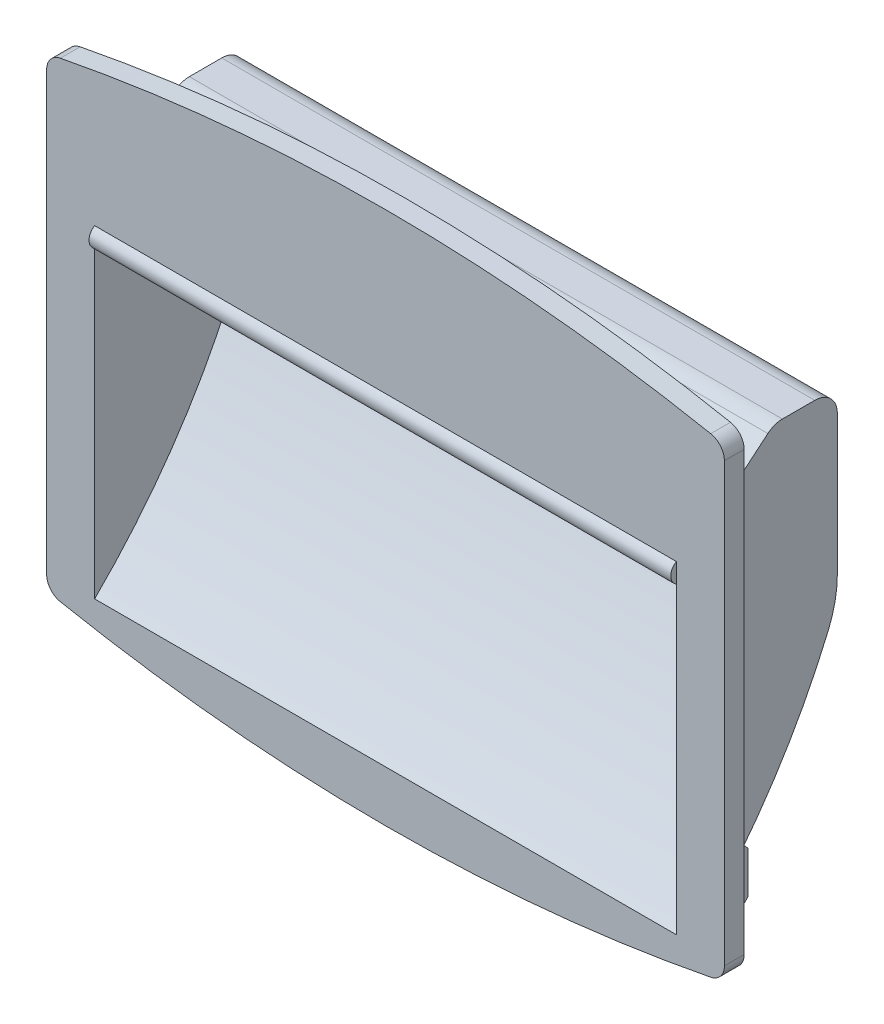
ISO-10303-21;
HEADER;
FILE_DESCRIPTION(('STEP AP214'),'2;1');
FILE_NAME('part.step','',(''),(''),'','','');
FILE_SCHEMA(('AUTOMOTIVE_DESIGN { 1 0 10303 214 1 1 1 1 }'));
ENDSEC;
DATA;
#1=APPLICATION_CONTEXT('core data for automotive mechanical design processes');
#2=APPLICATION_PROTOCOL_DEFINITION('international standard','automotive_design',2000,#1);
#3=PRODUCT_CONTEXT('',#1,'mechanical');
#4=PRODUCT('Part','Part','',(#3));
#5=PRODUCT_RELATED_PRODUCT_CATEGORY('part','',(#4));
#6=PRODUCT_DEFINITION_FORMATION('','',#4);
#7=PRODUCT_DEFINITION_CONTEXT('part definition',#1,'design');
#8=PRODUCT_DEFINITION('design','',#6,#7);
#9=PRODUCT_DEFINITION_SHAPE('','',#8);
#10=(LENGTH_UNIT() NAMED_UNIT(*) SI_UNIT(.MILLI.,.METRE.));
#11=(NAMED_UNIT(*) PLANE_ANGLE_UNIT() SI_UNIT($,.RADIAN.));
#12=(NAMED_UNIT(*) SI_UNIT($,.STERADIAN.) SOLID_ANGLE_UNIT());
#13=UNCERTAINTY_MEASURE_WITH_UNIT(LENGTH_MEASURE(1.E-05),#10,'distance_accuracy_value','');
#14=(GEOMETRIC_REPRESENTATION_CONTEXT(3) GLOBAL_UNCERTAINTY_ASSIGNED_CONTEXT((#13)) GLOBAL_UNIT_ASSIGNED_CONTEXT((#10,
#11,#12)) REPRESENTATION_CONTEXT('',''));
#15=CARTESIAN_POINT('',(0.,0.,0.));
#16=DIRECTION('',(0.,0.,1.));
#17=DIRECTION('',(1.,0.,0.));
#18=AXIS2_PLACEMENT_3D('',#15,#16,#17);
#19=CARTESIAN_POINT('',(-57.,-38.7289872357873,3.5));
#20=DIRECTION('',(0.,0.,1.));
#21=DIRECTION('',(1.,0.,0.));
#22=AXIS2_PLACEMENT_3D('',#19,#20,#21);
#23=PLANE('',#22);
#24=DIRECTION('',(0.,-1.,0.));
#25=VECTOR('',#24,1.);
#26=CARTESIAN_POINT('',(-60.,38.728987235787,3.5));
#27=LINE('',#26,#25);
#28=CARTESIAN_POINT('',(-60.,38.728987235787,3.5));
#29=VERTEX_POINT('',#28);
#30=CARTESIAN_POINT('',(-60.,-38.728987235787,3.5));
#31=VERTEX_POINT('',#30);
#32=EDGE_CURVE('E607',#29,#31,#27,.T.);
#33=ORIENTED_EDGE('',*,*,#32,.T.);
#34=CARTESIAN_POINT('',(-57.,-38.7289872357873,3.5));
#35=DIRECTION('',(0.,0.,1.));
#36=DIRECTION('',(1.,0.,0.));
#37=AXIS2_PLACEMENT_3D('',#34,#35,#36);
#38=CIRCLE('',#37,2.99999999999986);
#39=CARTESIAN_POINT('',(-57.575757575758,-41.673219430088,3.5));
#40=VERTEX_POINT('',#39);
#41=EDGE_CURVE('E608',#31,#40,#38,.T.);
#42=ORIENTED_EDGE('',*,*,#41,.T.);
#43=CARTESIAN_POINT('',(0.,252.750000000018,3.5));
#44=DIRECTION('',(0.,0.,1.));
#45=DIRECTION('',(1.,0.,0.));
#46=AXIS2_PLACEMENT_3D('',#43,#44,#45);
#47=CIRCLE('',#46,300.000000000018);
#48=CARTESIAN_POINT('',(57.575757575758,-41.673219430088,3.5));
#49=VERTEX_POINT('',#48);
#50=EDGE_CURVE('E612',#40,#49,#47,.T.);
#51=ORIENTED_EDGE('',*,*,#50,.T.);
#52=CARTESIAN_POINT('',(57.,-38.7289872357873,3.5));
#53=DIRECTION('',(0.,0.,1.));
#54=DIRECTION('',(-1.,0.,0.));
#55=AXIS2_PLACEMENT_3D('',#52,#53,#54);
#56=CIRCLE('',#55,2.99999999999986);
#57=CARTESIAN_POINT('',(60.,-38.728987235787,3.5));
#58=VERTEX_POINT('',#57);
#59=EDGE_CURVE('E616',#49,#58,#56,.T.);
#60=ORIENTED_EDGE('',*,*,#59,.T.);
#61=DIRECTION('',(0.,1.,0.));
#62=VECTOR('',#61,1.);
#63=CARTESIAN_POINT('',(60.,-38.728987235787,3.5));
#64=LINE('',#63,#62);
#65=CARTESIAN_POINT('',(60.,38.728987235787,3.5));
#66=VERTEX_POINT('',#65);
#67=EDGE_CURVE('E620',#58,#66,#64,.T.);
#68=ORIENTED_EDGE('',*,*,#67,.T.);
#69=CARTESIAN_POINT('',(57.,38.7289872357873,3.5));
#70=DIRECTION('',(0.,0.,1.));
#71=DIRECTION('',(1.,0.,0.));
#72=AXIS2_PLACEMENT_3D('',#69,#70,#71);
#73=CIRCLE('',#72,2.99999999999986);
#74=CARTESIAN_POINT('',(57.575757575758,41.673219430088,3.5));
#75=VERTEX_POINT('',#74);
#76=EDGE_CURVE('E624',#66,#75,#73,.T.);
#77=ORIENTED_EDGE('',*,*,#76,.T.);
#78=CARTESIAN_POINT('',(0.,-252.750000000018,3.5));
#79=DIRECTION('',(0.,0.,1.));
#80=DIRECTION('',(1.,0.,0.));
#81=AXIS2_PLACEMENT_3D('',#78,#79,#80);
#82=CIRCLE('',#81,300.000000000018);
#83=CARTESIAN_POINT('',(-57.575757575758,41.673219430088,3.5));
#84=VERTEX_POINT('',#83);
#85=EDGE_CURVE('E628',#75,#84,#82,.T.);
#86=ORIENTED_EDGE('',*,*,#85,.T.);
#87=CARTESIAN_POINT('',(-57.,38.7289872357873,3.5));
#88=DIRECTION('',(0.,0.,1.));
#89=DIRECTION('',(1.,0.,0.));
#90=AXIS2_PLACEMENT_3D('',#87,#88,#89);
#91=CIRCLE('',#90,2.99999999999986);
#92=EDGE_CURVE('E632',#84,#29,#91,.T.);
#93=ORIENTED_EDGE('',*,*,#92,.T.);
#94=EDGE_LOOP('',(#33,#42,#51,#60,#68,#77,#86,#93));
#95=FACE_BOUND('',#94,.T.);
#96=DIRECTION('',(1.,0.,0.));
#97=VECTOR('',#96,1.);
#98=CARTESIAN_POINT('',(-51.5,19.0320508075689,3.5));
#99=LINE('',#98,#97);
#100=CARTESIAN_POINT('',(51.5,19.0320508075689,3.5));
#101=VERTEX_POINT('',#100);
#102=CARTESIAN_POINT('',(-51.5,19.0320508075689,3.5));
#103=VERTEX_POINT('',#102);
#104=EDGE_CURVE('E29',#101,#103,#99,.F.);
#105=ORIENTED_EDGE('',*,*,#104,.F.);
#106=DIRECTION('',(0.,1.,0.));
#107=VECTOR('',#106,1.);
#108=CARTESIAN_POINT('',(51.5,-38.7289872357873,3.5));
#109=LINE('',#108,#107);
#110=CARTESIAN_POINT('',(51.5,15.5679491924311,3.5));
#111=VERTEX_POINT('',#110);
#112=EDGE_CURVE('E9',#111,#101,#109,.T.);
#113=ORIENTED_EDGE('',*,*,#112,.F.);
#114=DIRECTION('',(1.,0.,0.));
#115=VECTOR('',#114,1.);
#116=CARTESIAN_POINT('',(-51.5,15.5679491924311,3.5));
#117=LINE('',#116,#115);
#118=CARTESIAN_POINT('',(-51.5,15.5679491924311,3.5));
#119=VERTEX_POINT('',#118);
#120=EDGE_CURVE('E36',#119,#111,#117,.T.);
#121=ORIENTED_EDGE('',*,*,#120,.F.);
#122=DIRECTION('',(0.,1.,0.));
#123=VECTOR('',#122,1.);
#124=CARTESIAN_POINT('',(-51.5,-38.7289872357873,3.5));
#125=LINE('',#124,#123);
#126=EDGE_CURVE('E22',#119,#103,#125,.T.);
#127=ORIENTED_EDGE('',*,*,#126,.T.);
#128=EDGE_LOOP('',(#105,#113,#121,#127));
#129=FACE_BOUND('',#128,.T.);
#130=DIRECTION('',(0.,-1.,0.));
#131=VECTOR('',#130,1.);
#132=CARTESIAN_POINT('',(51.5,15.549633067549,3.5));
#133=LINE('',#132,#131);
#134=CARTESIAN_POINT('',(51.5,15.549633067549,3.5));
#135=VERTEX_POINT('',#134);
#136=CARTESIAN_POINT('',(51.5,-38.2,3.50000000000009));
#137=VERTEX_POINT('',#136);
#138=EDGE_CURVE('E367',#135,#137,#133,.T.);
#139=ORIENTED_EDGE('',*,*,#138,.T.);
#140=DIRECTION('',(1.,0.,0.));
#141=VECTOR('',#140,1.);
#142=CARTESIAN_POINT('',(-51.5,-38.2,3.50000000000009));
#143=LINE('',#142,#141);
#144=CARTESIAN_POINT('',(-51.5,-38.2,3.50000000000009));
#145=VERTEX_POINT('',#144);
#146=EDGE_CURVE('E349',#145,#137,#143,.T.);
#147=ORIENTED_EDGE('',*,*,#146,.F.);
#148=DIRECTION('',(0.,-1.,0.));
#149=VECTOR('',#148,1.);
#150=CARTESIAN_POINT('',(-51.5,15.549633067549,3.5));
#151=LINE('',#150,#149);
#152=CARTESIAN_POINT('',(-51.5,15.549633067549,3.5));
#153=VERTEX_POINT('',#152);
#154=EDGE_CURVE('E381',#153,#145,#151,.T.);
#155=ORIENTED_EDGE('',*,*,#154,.F.);
#156=DIRECTION('',(1.,0.,0.));
#157=VECTOR('',#156,1.);
#158=CARTESIAN_POINT('',(-51.5,15.549633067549,3.5));
#159=LINE('',#158,#157);
#160=EDGE_CURVE('E372',#153,#135,#159,.T.);
#161=ORIENTED_EDGE('',*,*,#160,.T.);
#162=EDGE_LOOP('',(#139,#147,#155,#161));
#163=FACE_BOUND('',#162,.T.);
#164=ADVANCED_FACE('F14',(#95,#129,#163),#23,.T.);
#165=CARTESIAN_POINT('',(-57.,-38.7289872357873,0.));
#166=DIRECTION('',(0.,0.,1.));
#167=DIRECTION('',(1.,0.,0.));
#168=AXIS2_PLACEMENT_3D('',#165,#166,#167);
#169=PLANE('',#168);
#170=DIRECTION('',(0.,-1.,0.));
#171=VECTOR('',#170,1.);
#172=CARTESIAN_POINT('',(-60.,38.728987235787,0.));
#173=LINE('',#172,#171);
#174=CARTESIAN_POINT('',(-60.,38.728987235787,0.));
#175=VERTEX_POINT('',#174);
#176=CARTESIAN_POINT('',(-60.,-38.728987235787,0.));
#177=VERTEX_POINT('',#176);
#178=EDGE_CURVE('E636',#175,#177,#173,.T.);
#179=ORIENTED_EDGE('',*,*,#178,.F.);
#180=CARTESIAN_POINT('',(-57.,38.7289872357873,0.));
#181=DIRECTION('',(0.,0.,1.));
#182=DIRECTION('',(1.,0.,0.));
#183=AXIS2_PLACEMENT_3D('',#180,#181,#182);
#184=CIRCLE('',#183,2.99999999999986);
#185=CARTESIAN_POINT('',(-57.575757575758,41.673219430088,0.));
#186=VERTEX_POINT('',#185);
#187=EDGE_CURVE('E658',#186,#175,#184,.T.);
#188=ORIENTED_EDGE('',*,*,#187,.F.);
#189=CARTESIAN_POINT('',(0.,-252.750000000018,0.));
#190=DIRECTION('',(0.,0.,1.));
#191=DIRECTION('',(1.,0.,0.));
#192=AXIS2_PLACEMENT_3D('',#189,#190,#191);
#193=CIRCLE('',#192,300.000000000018);
#194=CARTESIAN_POINT('',(57.575757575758,41.673219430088,0.));
#195=VERTEX_POINT('',#194);
#196=EDGE_CURVE('E655',#195,#186,#193,.T.);
#197=ORIENTED_EDGE('',*,*,#196,.F.);
#198=CARTESIAN_POINT('',(57.,38.7289872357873,0.));
#199=DIRECTION('',(0.,0.,1.));
#200=DIRECTION('',(1.,0.,0.));
#201=AXIS2_PLACEMENT_3D('',#198,#199,#200);
#202=CIRCLE('',#201,2.99999999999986);
#203=CARTESIAN_POINT('',(60.,38.728987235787,0.));
#204=VERTEX_POINT('',#203);
#205=EDGE_CURVE('E652',#204,#195,#202,.T.);
#206=ORIENTED_EDGE('',*,*,#205,.F.);
#207=DIRECTION('',(0.,1.,0.));
#208=VECTOR('',#207,1.);
#209=CARTESIAN_POINT('',(60.,-38.728987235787,0.));
#210=LINE('',#209,#208);
#211=CARTESIAN_POINT('',(60.,-38.728987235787,0.));
#212=VERTEX_POINT('',#211);
#213=EDGE_CURVE('E649',#212,#204,#210,.T.);
#214=ORIENTED_EDGE('',*,*,#213,.F.);
#215=CARTESIAN_POINT('',(57.,-38.7289872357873,0.));
#216=DIRECTION('',(0.,0.,1.));
#217=DIRECTION('',(-1.,0.,0.));
#218=AXIS2_PLACEMENT_3D('',#215,#216,#217);
#219=CIRCLE('',#218,2.99999999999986);
#220=CARTESIAN_POINT('',(57.575757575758,-41.673219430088,0.));
#221=VERTEX_POINT('',#220);
#222=EDGE_CURVE('E646',#221,#212,#219,.T.);
#223=ORIENTED_EDGE('',*,*,#222,.F.);
#224=CARTESIAN_POINT('',(0.,252.750000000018,0.));
#225=DIRECTION('',(0.,0.,1.));
#226=DIRECTION('',(1.,0.,0.));
#227=AXIS2_PLACEMENT_3D('',#224,#225,#226);
#228=CIRCLE('',#227,300.000000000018);
#229=CARTESIAN_POINT('',(-57.575757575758,-41.673219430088,0.));
#230=VERTEX_POINT('',#229);
#231=EDGE_CURVE('E643',#230,#221,#228,.T.);
#232=ORIENTED_EDGE('',*,*,#231,.F.);
#233=CARTESIAN_POINT('',(-57.,-38.7289872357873,0.));
#234=DIRECTION('',(0.,0.,1.));
#235=DIRECTION('',(1.,0.,0.));
#236=AXIS2_PLACEMENT_3D('',#233,#234,#235);
#237=CIRCLE('',#236,2.99999999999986);
#238=EDGE_CURVE('E640',#177,#230,#237,.T.);
#239=ORIENTED_EDGE('',*,*,#238,.F.);
#240=EDGE_LOOP('',(#179,#188,#197,#206,#214,#223,#232,#239));
#241=FACE_BOUND('',#240,.T.);
#242=DIRECTION('',(0.,-1.,0.));
#243=VECTOR('',#242,1.);
#244=CARTESIAN_POINT('',(40.,-38.7289872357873,0.));
#245=LINE('',#244,#243);
#246=CARTESIAN_POINT('',(40.,30.75,0.));
#247=VERTEX_POINT('',#246);
#248=CARTESIAN_POINT('',(40.,21.75,0.));
#249=VERTEX_POINT('',#248);
#250=EDGE_CURVE('E498',#247,#249,#245,.T.);
#251=ORIENTED_EDGE('',*,*,#250,.F.);
#252=DIRECTION('',(-1.,0.,0.));
#253=VECTOR('',#252,1.);
#254=CARTESIAN_POINT('',(-57.,30.75,0.));
#255=LINE('',#254,#253);
#256=CARTESIAN_POINT('',(38.,30.75,0.));
#257=VERTEX_POINT('',#256);
#258=EDGE_CURVE('E461',#247,#257,#255,.T.);
#259=ORIENTED_EDGE('',*,*,#258,.T.);
#260=DIRECTION('',(0.,1.,0.));
#261=VECTOR('',#260,1.);
#262=CARTESIAN_POINT('',(38.,-38.7289872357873,0.));
#263=LINE('',#262,#261);
#264=CARTESIAN_POINT('',(38.,21.75,0.));
#265=VERTEX_POINT('',#264);
#266=EDGE_CURVE('E495',#265,#257,#263,.T.);
#267=ORIENTED_EDGE('',*,*,#266,.F.);
#268=DIRECTION('',(1.,0.,0.));
#269=VECTOR('',#268,1.);
#270=CARTESIAN_POINT('',(-52.5,21.75,0.));
#271=LINE('',#270,#269);
#272=CARTESIAN_POINT('',(27.,21.75,0.));
#273=VERTEX_POINT('',#272);
#274=EDGE_CURVE('E862',#273,#265,#271,.T.);
#275=ORIENTED_EDGE('',*,*,#274,.F.);
#276=DIRECTION('',(0.,-1.,0.));
#277=VECTOR('',#276,1.);
#278=CARTESIAN_POINT('',(27.,-38.7289872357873,0.));
#279=LINE('',#278,#277);
#280=CARTESIAN_POINT('',(27.,30.75,0.));
#281=VERTEX_POINT('',#280);
#282=EDGE_CURVE('E492',#281,#273,#279,.T.);
#283=ORIENTED_EDGE('',*,*,#282,.F.);
#284=CARTESIAN_POINT('',(25.,30.75,0.));
#285=VERTEX_POINT('',#284);
#286=EDGE_CURVE('E817',#281,#285,#255,.T.);
#287=ORIENTED_EDGE('',*,*,#286,.T.);
#288=DIRECTION('',(0.,1.,0.));
#289=VECTOR('',#288,1.);
#290=CARTESIAN_POINT('',(25.,-38.7289872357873,0.));
#291=LINE('',#290,#289);
#292=CARTESIAN_POINT('',(25.,21.75,0.));
#293=VERTEX_POINT('',#292);
#294=EDGE_CURVE('E489',#293,#285,#291,.T.);
#295=ORIENTED_EDGE('',*,*,#294,.F.);
#296=CARTESIAN_POINT('',(14.,21.75,0.));
#297=VERTEX_POINT('',#296);
#298=EDGE_CURVE('E858',#297,#293,#271,.T.);
#299=ORIENTED_EDGE('',*,*,#298,.F.);
#300=DIRECTION('',(0.,-1.,0.));
#301=VECTOR('',#300,1.);
#302=CARTESIAN_POINT('',(14.,-38.7289872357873,0.));
#303=LINE('',#302,#301);
#304=CARTESIAN_POINT('',(14.,30.75,0.));
#305=VERTEX_POINT('',#304);
#306=EDGE_CURVE('E486',#305,#297,#303,.T.);
#307=ORIENTED_EDGE('',*,*,#306,.F.);
#308=CARTESIAN_POINT('',(12.,30.75,0.));
#309=VERTEX_POINT('',#308);
#310=EDGE_CURVE('E1018',#305,#309,#255,.T.);
#311=ORIENTED_EDGE('',*,*,#310,.T.);
#312=DIRECTION('',(0.,1.,0.));
#313=VECTOR('',#312,1.);
#314=CARTESIAN_POINT('',(12.,-38.7289872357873,0.));
#315=LINE('',#314,#313);
#316=CARTESIAN_POINT('',(12.,21.75,0.));
#317=VERTEX_POINT('',#316);
#318=EDGE_CURVE('E483',#317,#309,#315,.T.);
#319=ORIENTED_EDGE('',*,*,#318,.F.);
#320=CARTESIAN_POINT('',(0.999999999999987,21.75,0.));
#321=VERTEX_POINT('',#320);
#322=EDGE_CURVE('E854',#321,#317,#271,.T.);
#323=ORIENTED_EDGE('',*,*,#322,.F.);
#324=DIRECTION('',(0.,-1.,0.));
#325=VECTOR('',#324,1.);
#326=CARTESIAN_POINT('',(1.,-38.7289872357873,0.));
#327=LINE('',#326,#325);
#328=CARTESIAN_POINT('',(1.,30.75,0.));
#329=VERTEX_POINT('',#328);
#330=EDGE_CURVE('E480',#329,#321,#327,.T.);
#331=ORIENTED_EDGE('',*,*,#330,.F.);
#332=CARTESIAN_POINT('',(-1.,30.75,0.));
#333=VERTEX_POINT('',#332);
#334=EDGE_CURVE('E1019',#329,#333,#255,.T.);
#335=ORIENTED_EDGE('',*,*,#334,.T.);
#336=DIRECTION('',(0.,1.,0.));
#337=VECTOR('',#336,1.);
#338=CARTESIAN_POINT('',(-1.,-38.7289872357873,0.));
#339=LINE('',#338,#337);
#340=CARTESIAN_POINT('',(-1.00000000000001,21.75,0.));
#341=VERTEX_POINT('',#340);
#342=EDGE_CURVE('E477',#341,#333,#339,.T.);
#343=ORIENTED_EDGE('',*,*,#342,.F.);
#344=CARTESIAN_POINT('',(-12.,21.75,0.));
#345=VERTEX_POINT('',#344);
#346=EDGE_CURVE('E850',#345,#341,#271,.T.);
#347=ORIENTED_EDGE('',*,*,#346,.F.);
#348=DIRECTION('',(0.,-1.,0.));
#349=VECTOR('',#348,1.);
#350=CARTESIAN_POINT('',(-12.,-38.7289872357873,0.));
#351=LINE('',#350,#349);
#352=CARTESIAN_POINT('',(-12.,30.75,0.));
#353=VERTEX_POINT('',#352);
#354=EDGE_CURVE('E474',#353,#345,#351,.T.);
#355=ORIENTED_EDGE('',*,*,#354,.F.);
#356=CARTESIAN_POINT('',(-14.,30.75,0.));
#357=VERTEX_POINT('',#356);
#358=EDGE_CURVE('E1021',#353,#357,#255,.T.);
#359=ORIENTED_EDGE('',*,*,#358,.T.);
#360=DIRECTION('',(0.,1.,0.));
#361=VECTOR('',#360,1.);
#362=CARTESIAN_POINT('',(-14.,-38.7289872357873,0.));
#363=LINE('',#362,#361);
#364=CARTESIAN_POINT('',(-14.,21.75,0.));
#365=VERTEX_POINT('',#364);
#366=EDGE_CURVE('E471',#365,#357,#363,.T.);
#367=ORIENTED_EDGE('',*,*,#366,.F.);
#368=CARTESIAN_POINT('',(-25.,21.75,0.));
#369=VERTEX_POINT('',#368);
#370=EDGE_CURVE('E848',#369,#365,#271,.T.);
#371=ORIENTED_EDGE('',*,*,#370,.F.);
#372=DIRECTION('',(0.,-1.,0.));
#373=VECTOR('',#372,1.);
#374=CARTESIAN_POINT('',(-25.,-38.7289872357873,0.));
#375=LINE('',#374,#373);
#376=CARTESIAN_POINT('',(-25.,30.75,0.));
#377=VERTEX_POINT('',#376);
#378=EDGE_CURVE('E468',#377,#369,#375,.T.);
#379=ORIENTED_EDGE('',*,*,#378,.F.);
#380=CARTESIAN_POINT('',(-27.,30.75,0.));
#381=VERTEX_POINT('',#380);
#382=EDGE_CURVE('E460',#377,#381,#255,.T.);
#383=ORIENTED_EDGE('',*,*,#382,.T.);
#384=DIRECTION('',(0.,1.,0.));
#385=VECTOR('',#384,1.);
#386=CARTESIAN_POINT('',(-27.,-38.7289872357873,0.));
#387=LINE('',#386,#385);
#388=CARTESIAN_POINT('',(-27.,21.75,0.));
#389=VERTEX_POINT('',#388);
#390=EDGE_CURVE('E465',#389,#381,#387,.T.);
#391=ORIENTED_EDGE('',*,*,#390,.F.);
#392=CARTESIAN_POINT('',(-38.,21.75,0.));
#393=VERTEX_POINT('',#392);
#394=EDGE_CURVE('E593',#393,#389,#271,.T.);
#395=ORIENTED_EDGE('',*,*,#394,.F.);
#396=DIRECTION('',(0.,-1.,0.));
#397=VECTOR('',#396,1.);
#398=CARTESIAN_POINT('',(-38.,-38.7289872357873,0.));
#399=LINE('',#398,#397);
#400=CARTESIAN_POINT('',(-38.,30.75,0.));
#401=VERTEX_POINT('',#400);
#402=EDGE_CURVE('E462',#401,#393,#399,.T.);
#403=ORIENTED_EDGE('',*,*,#402,.F.);
#404=CARTESIAN_POINT('',(-40.,30.75,0.));
#405=VERTEX_POINT('',#404);
#406=EDGE_CURVE('E456',#401,#405,#255,.T.);
#407=ORIENTED_EDGE('',*,*,#406,.T.);
#408=DIRECTION('',(0.,1.,0.));
#409=VECTOR('',#408,1.);
#410=CARTESIAN_POINT('',(-40.,-38.7289872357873,0.));
#411=LINE('',#410,#409);
#412=CARTESIAN_POINT('',(-40.,21.75,0.));
#413=VERTEX_POINT('',#412);
#414=EDGE_CURVE('E501',#413,#405,#411,.T.);
#415=ORIENTED_EDGE('',*,*,#414,.F.);
#416=CARTESIAN_POINT('',(-52.5,21.75,0.));
#417=VERTEX_POINT('',#416);
#418=EDGE_CURVE('E589',#417,#413,#271,.T.);
#419=ORIENTED_EDGE('',*,*,#418,.F.);
#420=DIRECTION('',(0.,-1.,0.));
#421=VECTOR('',#420,1.);
#422=CARTESIAN_POINT('',(-52.5,21.75,0.));
#423=LINE('',#422,#421);
#424=CARTESIAN_POINT('',(-52.5,-38.2,1.10154940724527E-13));
#425=VERTEX_POINT('',#424);
#426=EDGE_CURVE('E563',#417,#425,#423,.T.);
#427=ORIENTED_EDGE('',*,*,#426,.T.);
#428=DIRECTION('',(1.,0.,0.));
#429=VECTOR('',#428,1.);
#430=CARTESIAN_POINT('',(-52.5,-38.2,1.10154940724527E-13));
#431=LINE('',#430,#429);
#432=CARTESIAN_POINT('',(52.5,-38.2,0.));
#433=VERTEX_POINT('',#432);
#434=EDGE_CURVE('E605',#425,#433,#431,.T.);
#435=ORIENTED_EDGE('',*,*,#434,.T.);
#436=DIRECTION('',(0.,-1.,0.));
#437=VECTOR('',#436,1.);
#438=CARTESIAN_POINT('',(52.5,21.75,0.));
#439=LINE('',#438,#437);
#440=CARTESIAN_POINT('',(52.5,21.75,0.));
#441=VERTEX_POINT('',#440);
#442=EDGE_CURVE('E541',#441,#433,#439,.T.);
#443=ORIENTED_EDGE('',*,*,#442,.F.);
#444=EDGE_CURVE('E586',#249,#441,#271,.T.);
#445=ORIENTED_EDGE('',*,*,#444,.F.);
#446=EDGE_LOOP('',(#251,#259,#267,#275,#283,#287,#295,#299,#307,#311,#319,#323,#331,#335,#343,
#347,#355,#359,#367,#371,#379,#383,#391,#395,#403,#407,#415,#419,#427,#435,#443,#445));
#447=FACE_BOUND('',#446,.T.);
#448=ADVANCED_FACE('F745',(#241,#447),#169,.F.);
#449=CARTESIAN_POINT('',(-52.5,31.564177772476,-11.696081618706));
#450=DIRECTION('',(0.,0.766044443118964,0.642787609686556));
#451=DIRECTION('',(0.,-0.642787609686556,0.766044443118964));
#452=AXIS2_PLACEMENT_3D('',#449,#450,#451);
#453=PLANE('',#452);
#454=DIRECTION('',(-1.,0.,0.));
#455=VECTOR('',#454,1.);
#456=CARTESIAN_POINT('',(-52.5,30.75,-10.7257823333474));
#457=LINE('',#456,#455);
#458=CARTESIAN_POINT('',(40.,30.75,-10.7257823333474));
#459=VERTEX_POINT('',#458);
#460=CARTESIAN_POINT('',(38.,30.75,-10.7257823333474));
#461=VERTEX_POINT('',#460);
#462=EDGE_CURVE('E692',#459,#461,#457,.T.);
#463=ORIENTED_EDGE('',*,*,#462,.F.);
#464=DIRECTION('',(0.,-0.642787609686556,0.766044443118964));
#465=VECTOR('',#464,1.);
#466=CARTESIAN_POINT('',(40.,31.564177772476,-11.696081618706));
#467=LINE('',#466,#465);
#468=EDGE_CURVE('E723',#459,#249,#467,.T.);
#469=ORIENTED_EDGE('',*,*,#468,.T.);
#470=ORIENTED_EDGE('',*,*,#444,.T.);
#471=DIRECTION('',(0.,-0.642787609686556,0.766044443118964));
#472=VECTOR('',#471,1.);
#473=CARTESIAN_POINT('',(52.5,31.564177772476,-11.696081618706));
#474=LINE('',#473,#472);
#475=CARTESIAN_POINT('',(52.5,31.564177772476,-11.696081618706));
#476=VERTEX_POINT('',#475);
#477=EDGE_CURVE('E560',#476,#441,#474,.T.);
#478=ORIENTED_EDGE('',*,*,#477,.F.);
#479=DIRECTION('',(1.,0.,0.));
#480=VECTOR('',#479,1.);
#481=CARTESIAN_POINT('',(-52.5,31.564177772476,-11.696081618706));
#482=LINE('',#481,#480);
#483=CARTESIAN_POINT('',(-52.5,31.564177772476,-11.696081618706));
#484=VERTEX_POINT('',#483);
#485=EDGE_CURVE('E592',#484,#476,#482,.T.);
#486=ORIENTED_EDGE('',*,*,#485,.F.);
#487=DIRECTION('',(0.,-0.642787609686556,0.766044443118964));
#488=VECTOR('',#487,1.);
#489=CARTESIAN_POINT('',(-52.5,31.564177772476,-11.696081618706));
#490=LINE('',#489,#488);
#491=EDGE_CURVE('E584',#484,#417,#490,.T.);
#492=ORIENTED_EDGE('',*,*,#491,.T.);
#493=ORIENTED_EDGE('',*,*,#418,.T.);
#494=DIRECTION('',(0.,0.642787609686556,-0.766044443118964));
#495=VECTOR('',#494,1.);
#496=CARTESIAN_POINT('',(-40.,31.564177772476,-11.696081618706));
#497=LINE('',#496,#495);
#498=CARTESIAN_POINT('',(-40.,30.75,-10.7257823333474));
#499=VERTEX_POINT('',#498);
#500=EDGE_CURVE('E695',#413,#499,#497,.T.);
#501=ORIENTED_EDGE('',*,*,#500,.T.);
#502=CARTESIAN_POINT('',(-38.,30.75,-10.7257823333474));
#503=VERTEX_POINT('',#502);
#504=EDGE_CURVE('E688',#503,#499,#457,.T.);
#505=ORIENTED_EDGE('',*,*,#504,.F.);
#506=DIRECTION('',(0.,-0.642787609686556,0.766044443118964));
#507=VECTOR('',#506,1.);
#508=CARTESIAN_POINT('',(-38.,31.564177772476,-11.696081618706));
#509=LINE('',#508,#507);
#510=EDGE_CURVE('E691',#503,#393,#509,.T.);
#511=ORIENTED_EDGE('',*,*,#510,.T.);
#512=ORIENTED_EDGE('',*,*,#394,.T.);
#513=DIRECTION('',(0.,0.642787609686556,-0.766044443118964));
#514=VECTOR('',#513,1.);
#515=CARTESIAN_POINT('',(-27.,31.564177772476,-11.696081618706));
#516=LINE('',#515,#514);
#517=CARTESIAN_POINT('',(-27.,30.75,-10.7257823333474));
#518=VERTEX_POINT('',#517);
#519=EDGE_CURVE('E697',#389,#518,#516,.T.);
#520=ORIENTED_EDGE('',*,*,#519,.T.);
#521=CARTESIAN_POINT('',(-25.,30.75,-10.7257823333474));
#522=VERTEX_POINT('',#521);
#523=EDGE_CURVE('E693',#522,#518,#457,.T.);
#524=ORIENTED_EDGE('',*,*,#523,.F.);
#525=DIRECTION('',(0.,-0.642787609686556,0.766044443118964));
#526=VECTOR('',#525,1.);
#527=CARTESIAN_POINT('',(-25.,31.564177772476,-11.696081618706));
#528=LINE('',#527,#526);
#529=EDGE_CURVE('E699',#522,#369,#528,.T.);
#530=ORIENTED_EDGE('',*,*,#529,.T.);
#531=ORIENTED_EDGE('',*,*,#370,.T.);
#532=DIRECTION('',(0.,0.642787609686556,-0.766044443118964));
#533=VECTOR('',#532,1.);
#534=CARTESIAN_POINT('',(-14.,31.564177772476,-11.696081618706));
#535=LINE('',#534,#533);
#536=CARTESIAN_POINT('',(-14.,30.75,-10.7257823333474));
#537=VERTEX_POINT('',#536);
#538=EDGE_CURVE('E702',#365,#537,#535,.T.);
#539=ORIENTED_EDGE('',*,*,#538,.T.);
#540=CARTESIAN_POINT('',(-12.,30.75,-10.7257823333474));
#541=VERTEX_POINT('',#540);
#542=EDGE_CURVE('E701',#541,#537,#457,.T.);
#543=ORIENTED_EDGE('',*,*,#542,.F.);
#544=DIRECTION('',(0.,-0.642787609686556,0.766044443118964));
#545=VECTOR('',#544,1.);
#546=CARTESIAN_POINT('',(-12.,31.564177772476,-11.696081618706));
#547=LINE('',#546,#545);
#548=EDGE_CURVE('E704',#541,#345,#547,.T.);
#549=ORIENTED_EDGE('',*,*,#548,.T.);
#550=ORIENTED_EDGE('',*,*,#346,.T.);
#551=DIRECTION('',(0.,0.642787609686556,-0.766044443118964));
#552=VECTOR('',#551,1.);
#553=CARTESIAN_POINT('',(-1.,31.564177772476,-11.696081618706));
#554=LINE('',#553,#552);
#555=CARTESIAN_POINT('',(-1.,30.75,-10.7257823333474));
#556=VERTEX_POINT('',#555);
#557=EDGE_CURVE('E707',#341,#556,#554,.T.);
#558=ORIENTED_EDGE('',*,*,#557,.T.);
#559=CARTESIAN_POINT('',(0.999999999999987,30.75,-10.7257823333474));
#560=VERTEX_POINT('',#559);
#561=EDGE_CURVE('E706',#560,#556,#457,.T.);
#562=ORIENTED_EDGE('',*,*,#561,.F.);
#563=DIRECTION('',(0.,-0.642787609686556,0.766044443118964));
#564=VECTOR('',#563,1.);
#565=CARTESIAN_POINT('',(1.,31.564177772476,-11.696081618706));
#566=LINE('',#565,#564);
#567=EDGE_CURVE('E709',#560,#321,#566,.T.);
#568=ORIENTED_EDGE('',*,*,#567,.T.);
#569=ORIENTED_EDGE('',*,*,#322,.T.);
#570=DIRECTION('',(0.,0.642787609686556,-0.766044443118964));
#571=VECTOR('',#570,1.);
#572=CARTESIAN_POINT('',(12.,31.564177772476,-11.696081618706));
#573=LINE('',#572,#571);
#574=CARTESIAN_POINT('',(12.,30.75,-10.7257823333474));
#575=VERTEX_POINT('',#574);
#576=EDGE_CURVE('E712',#317,#575,#573,.T.);
#577=ORIENTED_EDGE('',*,*,#576,.T.);
#578=CARTESIAN_POINT('',(14.,30.75,-10.7257823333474));
#579=VERTEX_POINT('',#578);
#580=EDGE_CURVE('E711',#579,#575,#457,.T.);
#581=ORIENTED_EDGE('',*,*,#580,.F.);
#582=DIRECTION('',(0.,-0.642787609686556,0.766044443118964));
#583=VECTOR('',#582,1.);
#584=CARTESIAN_POINT('',(14.,31.564177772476,-11.696081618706));
#585=LINE('',#584,#583);
#586=EDGE_CURVE('E714',#579,#297,#585,.T.);
#587=ORIENTED_EDGE('',*,*,#586,.T.);
#588=ORIENTED_EDGE('',*,*,#298,.T.);
#589=DIRECTION('',(0.,0.642787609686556,-0.766044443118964));
#590=VECTOR('',#589,1.);
#591=CARTESIAN_POINT('',(25.,31.564177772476,-11.696081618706));
#592=LINE('',#591,#590);
#593=CARTESIAN_POINT('',(25.,30.75,-10.7257823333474));
#594=VERTEX_POINT('',#593);
#595=EDGE_CURVE('E717',#293,#594,#592,.T.);
#596=ORIENTED_EDGE('',*,*,#595,.T.);
#597=CARTESIAN_POINT('',(27.,30.75,-10.7257823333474));
#598=VERTEX_POINT('',#597);
#599=EDGE_CURVE('E716',#598,#594,#457,.T.);
#600=ORIENTED_EDGE('',*,*,#599,.F.);
#601=DIRECTION('',(0.,-0.642787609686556,0.766044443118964));
#602=VECTOR('',#601,1.);
#603=CARTESIAN_POINT('',(27.,31.564177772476,-11.696081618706));
#604=LINE('',#603,#602);
#605=EDGE_CURVE('E719',#598,#273,#604,.T.);
#606=ORIENTED_EDGE('',*,*,#605,.T.);
#607=ORIENTED_EDGE('',*,*,#274,.T.);
#608=DIRECTION('',(0.,0.642787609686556,-0.766044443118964));
#609=VECTOR('',#608,1.);
#610=CARTESIAN_POINT('',(38.,31.564177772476,-11.696081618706));
#611=LINE('',#610,#609);
#612=EDGE_CURVE('E721',#265,#461,#611,.T.);
#613=ORIENTED_EDGE('',*,*,#612,.T.);
#614=EDGE_LOOP('',(#463,#469,#470,#478,#486,#492,#493,#501,#505,#511,#512,#520,#524,#530,#531,
#539,#543,#549,#550,#558,#562,#568,#569,#577,#581,#587,#588,#596,#600,#606,#607,#613));
#615=FACE_BOUND('',#614,.T.);
#616=ADVANCED_FACE('F752',(#615),#453,.T.);
#617=CARTESIAN_POINT('',(-52.5,40.8904239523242,83.4847581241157));
#618=DIRECTION('',(1.,0.,0.));
#619=DIRECTION('',(0.,0.,-1.));
#620=AXIS2_PLACEMENT_3D('',#617,#618,#619);
#621=CYLINDRICAL_SURFACE('',#620,115.000000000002);
#622=DIRECTION('',(1.,0.,0.));
#623=VECTOR('',#622,1.);
#624=CARTESIAN_POINT('',(-52.5,-3.93857227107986,-22.417843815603));
#625=LINE('',#624,#623);
#626=CARTESIAN_POINT('',(-52.5,-3.93857227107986,-22.417843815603));
#627=VERTEX_POINT('',#626);
#628=CARTESIAN_POINT('',(52.5,-3.93857227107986,-22.417843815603));
#629=VERTEX_POINT('',#628);
#630=EDGE_CURVE('E603',#627,#629,#625,.T.);
#631=ORIENTED_EDGE('',*,*,#630,.T.);
#632=CARTESIAN_POINT('',(52.5,40.8904239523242,83.4847581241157));
#633=DIRECTION('',(1.,0.,0.));
#634=DIRECTION('',(0.,1.,0.));
#635=AXIS2_PLACEMENT_3D('',#632,#633,#634);
#636=CIRCLE('',#635,115.000000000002);
#637=EDGE_CURVE('E542',#433,#629,#636,.T.);
#638=ORIENTED_EDGE('',*,*,#637,.F.);
#639=ORIENTED_EDGE('',*,*,#434,.F.);
#640=CARTESIAN_POINT('',(-52.5,40.8904239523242,83.4847581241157));
#641=DIRECTION('',(1.,0.,0.));
#642=DIRECTION('',(0.,1.,0.));
#643=AXIS2_PLACEMENT_3D('',#640,#641,#642);
#644=CIRCLE('',#643,115.000000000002);
#645=EDGE_CURVE('E566',#425,#627,#644,.T.);
#646=ORIENTED_EDGE('',*,*,#645,.T.);
#647=EDGE_LOOP('',(#631,#638,#639,#646));
#648=FACE_BOUND('',#647,.T.);
#649=DIRECTION('',(1.,0.,0.));
#650=VECTOR('',#649,1.);
#651=CARTESIAN_POINT('',(-52.5,-37.7365610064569,-0.436617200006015));
#652=LINE('',#651,#650);
#653=CARTESIAN_POINT('',(50.,-37.7365610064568,-0.436617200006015));
#654=VERTEX_POINT('',#653);
#655=CARTESIAN_POINT('',(-50.,-37.7365610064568,-0.436617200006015));
#656=VERTEX_POINT('',#655);
#657=EDGE_CURVE('E681',#654,#656,#652,.F.);
#658=ORIENTED_EDGE('',*,*,#657,.F.);
#659=CARTESIAN_POINT('',(50.,40.8904239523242,83.4847581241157));
#660=DIRECTION('',(-1.,0.,0.));
#661=DIRECTION('',(0.,-1.,0.));
#662=AXIS2_PLACEMENT_3D('',#659,#660,#661);
#663=CIRCLE('',#662,115.000000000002);
#664=CARTESIAN_POINT('',(50.,-29.2696838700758,-7.633622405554));
#665=VERTEX_POINT('',#664);
#666=EDGE_CURVE('E685',#654,#665,#663,.F.);
#667=ORIENTED_EDGE('',*,*,#666,.T.);
#668=DIRECTION('',(1.,0.,0.));
#669=VECTOR('',#668,1.);
#670=CARTESIAN_POINT('',(-52.5,-29.2696838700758,-7.633622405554));
#671=LINE('',#670,#669);
#672=CARTESIAN_POINT('',(-50.,-29.2696838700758,-7.633622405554));
#673=VERTEX_POINT('',#672);
#674=EDGE_CURVE('E679',#673,#665,#671,.T.);
#675=ORIENTED_EDGE('',*,*,#674,.F.);
#676=CARTESIAN_POINT('',(-50.,40.8904239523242,83.4847581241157));
#677=DIRECTION('',(-1.,0.,0.));
#678=DIRECTION('',(0.,-1.,0.));
#679=AXIS2_PLACEMENT_3D('',#676,#677,#678);
#680=CIRCLE('',#679,115.000000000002);
#681=EDGE_CURVE('E683',#656,#673,#680,.F.);
#682=ORIENTED_EDGE('',*,*,#681,.F.);
#683=EDGE_LOOP('',(#658,#667,#675,#682));
#684=FACE_BOUND('',#683,.T.);
#685=ADVANCED_FACE('F756',(#648,#684),#621,.T.);
#686=CARTESIAN_POINT('',(-60.,38.728987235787,0.));
#687=DIRECTION('',(-1.,0.,0.));
#688=DIRECTION('',(0.,0.,1.));
#689=AXIS2_PLACEMENT_3D('',#686,#687,#688);
#690=PLANE('',#689);
#691=ORIENTED_EDGE('',*,*,#32,.F.);
#692=DIRECTION('',(0.,0.,1.));
#693=VECTOR('',#692,1.);
#694=CARTESIAN_POINT('',(-60.,38.728987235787,0.));
#695=LINE('',#694,#693);
#696=EDGE_CURVE('E661',#175,#29,#695,.T.);
#697=ORIENTED_EDGE('',*,*,#696,.F.);
#698=ORIENTED_EDGE('',*,*,#178,.T.);
#699=DIRECTION('',(0.,0.,1.));
#700=VECTOR('',#699,1.);
#701=CARTESIAN_POINT('',(-60.,-38.728987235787,0.));
#702=LINE('',#701,#700);
#703=EDGE_CURVE('E677',#177,#31,#702,.T.);
#704=ORIENTED_EDGE('',*,*,#703,.T.);
#705=EDGE_LOOP('',(#691,#697,#698,#704));
#706=FACE_BOUND('',#705,.T.);
#707=ADVANCED_FACE('F16',(#706),#690,.T.);
#708=CARTESIAN_POINT('',(-57.,-38.7289872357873,0.));
#709=DIRECTION('',(0.,0.,1.));
#710=DIRECTION('',(1.,0.,0.));
#711=AXIS2_PLACEMENT_3D('',#708,#709,#710);
#712=CYLINDRICAL_SURFACE('',#711,2.99999999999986);
#713=ORIENTED_EDGE('',*,*,#41,.F.);
#714=ORIENTED_EDGE('',*,*,#703,.F.);
#715=ORIENTED_EDGE('',*,*,#238,.T.);
#716=DIRECTION('',(0.,0.,1.));
#717=VECTOR('',#716,1.);
#718=CARTESIAN_POINT('',(-57.575757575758,-41.673219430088,0.));
#719=LINE('',#718,#717);
#720=EDGE_CURVE('E675',#230,#40,#719,.T.);
#721=ORIENTED_EDGE('',*,*,#720,.T.);
#722=EDGE_LOOP('',(#713,#714,#715,#721));
#723=FACE_BOUND('',#722,.T.);
#724=ADVANCED_FACE('F782',(#723),#712,.T.);
#725=CARTESIAN_POINT('',(0.,252.750000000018,0.));
#726=DIRECTION('',(0.,0.,1.));
#727=DIRECTION('',(1.,0.,0.));
#728=AXIS2_PLACEMENT_3D('',#725,#726,#727);
#729=CYLINDRICAL_SURFACE('',#728,300.000000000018);
#730=ORIENTED_EDGE('',*,*,#50,.F.);
#731=ORIENTED_EDGE('',*,*,#720,.F.);
#732=ORIENTED_EDGE('',*,*,#231,.T.);
#733=DIRECTION('',(0.,0.,1.));
#734=VECTOR('',#733,1.);
#735=CARTESIAN_POINT('',(57.575757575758,-41.673219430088,0.));
#736=LINE('',#735,#734);
#737=EDGE_CURVE('E673',#221,#49,#736,.T.);
#738=ORIENTED_EDGE('',*,*,#737,.T.);
#739=EDGE_LOOP('',(#730,#731,#732,#738));
#740=FACE_BOUND('',#739,.T.);
#741=ADVANCED_FACE('F779',(#740),#729,.T.);
#742=CARTESIAN_POINT('',(57.,-38.7289872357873,0.));
#743=DIRECTION('',(0.,0.,1.));
#744=DIRECTION('',(1.,0.,0.));
#745=AXIS2_PLACEMENT_3D('',#742,#743,#744);
#746=CYLINDRICAL_SURFACE('',#745,2.99999999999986);
#747=ORIENTED_EDGE('',*,*,#59,.F.);
#748=ORIENTED_EDGE('',*,*,#737,.F.);
#749=ORIENTED_EDGE('',*,*,#222,.T.);
#750=DIRECTION('',(0.,0.,1.));
#751=VECTOR('',#750,1.);
#752=CARTESIAN_POINT('',(60.,-38.728987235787,0.));
#753=LINE('',#752,#751);
#754=EDGE_CURVE('E671',#212,#58,#753,.T.);
#755=ORIENTED_EDGE('',*,*,#754,.T.);
#756=EDGE_LOOP('',(#747,#748,#749,#755));
#757=FACE_BOUND('',#756,.T.);
#758=ADVANCED_FACE('F775',(#757),#746,.T.);
#759=CARTESIAN_POINT('',(60.,-38.728987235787,0.));
#760=DIRECTION('',(1.,0.,0.));
#761=DIRECTION('',(0.,0.,-1.));
#762=AXIS2_PLACEMENT_3D('',#759,#760,#761);
#763=PLANE('',#762);
#764=ORIENTED_EDGE('',*,*,#67,.F.);
#765=ORIENTED_EDGE('',*,*,#754,.F.);
#766=ORIENTED_EDGE('',*,*,#213,.T.);
#767=DIRECTION('',(0.,0.,1.));
#768=VECTOR('',#767,1.);
#769=CARTESIAN_POINT('',(60.,38.728987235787,0.));
#770=LINE('',#769,#768);
#771=EDGE_CURVE('E669',#204,#66,#770,.T.);
#772=ORIENTED_EDGE('',*,*,#771,.T.);
#773=EDGE_LOOP('',(#764,#765,#766,#772));
#774=FACE_BOUND('',#773,.T.);
#775=ADVANCED_FACE('F771',(#774),#763,.T.);
#776=CARTESIAN_POINT('',(57.,38.7289872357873,0.));
#777=DIRECTION('',(0.,0.,1.));
#778=DIRECTION('',(1.,0.,0.));
#779=AXIS2_PLACEMENT_3D('',#776,#777,#778);
#780=CYLINDRICAL_SURFACE('',#779,2.99999999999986);
#781=ORIENTED_EDGE('',*,*,#76,.F.);
#782=ORIENTED_EDGE('',*,*,#771,.F.);
#783=ORIENTED_EDGE('',*,*,#205,.T.);
#784=DIRECTION('',(0.,0.,1.));
#785=VECTOR('',#784,1.);
#786=CARTESIAN_POINT('',(57.575757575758,41.673219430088,0.));
#787=LINE('',#786,#785);
#788=EDGE_CURVE('E667',#195,#75,#787,.T.);
#789=ORIENTED_EDGE('',*,*,#788,.T.);
#790=EDGE_LOOP('',(#781,#782,#783,#789));
#791=FACE_BOUND('',#790,.T.);
#792=ADVANCED_FACE('F767',(#791),#780,.T.);
#793=CARTESIAN_POINT('',(0.,-252.750000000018,0.));
#794=DIRECTION('',(0.,0.,1.));
#795=DIRECTION('',(1.,0.,0.));
#796=AXIS2_PLACEMENT_3D('',#793,#794,#795);
#797=CYLINDRICAL_SURFACE('',#796,300.000000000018);
#798=ORIENTED_EDGE('',*,*,#85,.F.);
#799=ORIENTED_EDGE('',*,*,#788,.F.);
#800=ORIENTED_EDGE('',*,*,#196,.T.);
#801=DIRECTION('',(0.,0.,1.));
#802=VECTOR('',#801,1.);
#803=CARTESIAN_POINT('',(-57.575757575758,41.673219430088,0.));
#804=LINE('',#803,#802);
#805=EDGE_CURVE('E665',#186,#84,#804,.T.);
#806=ORIENTED_EDGE('',*,*,#805,.T.);
#807=EDGE_LOOP('',(#798,#799,#800,#806));
#808=FACE_BOUND('',#807,.T.);
#809=ADVANCED_FACE('F763',(#808),#797,.T.);
#810=CARTESIAN_POINT('',(-57.,38.7289872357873,0.));
#811=DIRECTION('',(0.,0.,1.));
#812=DIRECTION('',(1.,0.,0.));
#813=AXIS2_PLACEMENT_3D('',#810,#811,#812);
#814=CYLINDRICAL_SURFACE('',#813,2.99999999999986);
#815=ORIENTED_EDGE('',*,*,#92,.F.);
#816=ORIENTED_EDGE('',*,*,#805,.F.);
#817=ORIENTED_EDGE('',*,*,#187,.T.);
#818=ORIENTED_EDGE('',*,*,#696,.T.);
#819=EDGE_LOOP('',(#815,#816,#817,#818));
#820=FACE_BOUND('',#819,.T.);
#821=ADVANCED_FACE('F759',(#820),#814,.T.);
#822=CARTESIAN_POINT('',(-52.5,3.85777489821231,-3.99999999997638));
#823=DIRECTION('',(1.,0.,0.));
#824=DIRECTION('',(0.,0.,-1.));
#825=AXIS2_PLACEMENT_3D('',#822,#823,#824);
#826=CYLINDRICAL_SURFACE('',#825,20.0000000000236);
#827=DIRECTION('',(1.,0.,0.));
#828=VECTOR('',#827,1.);
#829=CARTESIAN_POINT('',(-52.5,3.8577748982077,-24.));
#830=LINE('',#829,#828);
#831=CARTESIAN_POINT('',(-52.5,3.8577748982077,-24.));
#832=VERTEX_POINT('',#831);
#833=CARTESIAN_POINT('',(52.5,3.8577748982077,-24.));
#834=VERTEX_POINT('',#833);
#835=EDGE_CURVE('E601',#832,#834,#830,.T.);
#836=ORIENTED_EDGE('',*,*,#835,.T.);
#837=CARTESIAN_POINT('',(52.5,3.85777489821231,-3.99999999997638));
#838=DIRECTION('',(1.,0.,0.));
#839=DIRECTION('',(0.,1.,0.));
#840=AXIS2_PLACEMENT_3D('',#837,#838,#839);
#841=CIRCLE('',#840,20.0000000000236);
#842=EDGE_CURVE('E545',#629,#834,#841,.T.);
#843=ORIENTED_EDGE('',*,*,#842,.F.);
#844=ORIENTED_EDGE('',*,*,#630,.F.);
#845=CARTESIAN_POINT('',(-52.5,3.85777489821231,-3.99999999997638));
#846=DIRECTION('',(1.,0.,0.));
#847=DIRECTION('',(0.,1.,0.));
#848=AXIS2_PLACEMENT_3D('',#845,#846,#847);
#849=CIRCLE('',#848,20.0000000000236);
#850=EDGE_CURVE('E569',#627,#832,#849,.T.);
#851=ORIENTED_EDGE('',*,*,#850,.T.);
#852=EDGE_LOOP('',(#836,#843,#844,#851));
#853=FACE_BOUND('',#852,.T.);
#854=ADVANCED_FACE('F762',(#853),#826,.T.);
#855=CARTESIAN_POINT('',(-52.5,3.8577748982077,-24.));
#856=DIRECTION('',(0.,0.,-1.));
#857=DIRECTION('',(-1.,0.,0.));
#858=AXIS2_PLACEMENT_3D('',#855,#856,#857);
#859=PLANE('',#858);
#860=DIRECTION('',(1.,0.,0.));
#861=VECTOR('',#860,1.);
#862=CARTESIAN_POINT('',(-52.5,28.5,-24.));
#863=LINE('',#862,#861);
#864=CARTESIAN_POINT('',(-52.5,28.5,-24.));
#865=VERTEX_POINT('',#864);
#866=CARTESIAN_POINT('',(52.5,28.5,-24.));
#867=VERTEX_POINT('',#866);
#868=EDGE_CURVE('E599',#865,#867,#863,.T.);
#869=ORIENTED_EDGE('',*,*,#868,.T.);
#870=DIRECTION('',(0.,1.,0.));
#871=VECTOR('',#870,1.);
#872=CARTESIAN_POINT('',(52.5,3.8577748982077,-24.));
#873=LINE('',#872,#871);
#874=EDGE_CURVE('E548',#834,#867,#873,.T.);
#875=ORIENTED_EDGE('',*,*,#874,.F.);
#876=ORIENTED_EDGE('',*,*,#835,.F.);
#877=DIRECTION('',(0.,1.,0.));
#878=VECTOR('',#877,1.);
#879=CARTESIAN_POINT('',(-52.5,3.8577748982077,-24.));
#880=LINE('',#879,#878);
#881=EDGE_CURVE('E572',#832,#865,#880,.T.);
#882=ORIENTED_EDGE('',*,*,#881,.T.);
#883=EDGE_LOOP('',(#869,#875,#876,#882));
#884=FACE_BOUND('',#883,.T.);
#885=ADVANCED_FACE('F938',(#884),#859,.T.);
#886=CARTESIAN_POINT('',(-52.5,28.4999999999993,-19.9999999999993));
#887=DIRECTION('',(1.,0.,0.));
#888=DIRECTION('',(0.,0.,-1.));
#889=AXIS2_PLACEMENT_3D('',#886,#887,#888);
#890=CYLINDRICAL_SURFACE('',#889,4.00000000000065);
#891=DIRECTION('',(1.,0.,0.));
#892=VECTOR('',#891,1.);
#893=CARTESIAN_POINT('',(-52.5,32.5,-19.9999999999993));
#894=LINE('',#893,#892);
#895=CARTESIAN_POINT('',(-52.5,32.5,-19.9999999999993));
#896=VERTEX_POINT('',#895);
#897=CARTESIAN_POINT('',(52.5,32.5,-19.9999999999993));
#898=VERTEX_POINT('',#897);
#899=EDGE_CURVE('E597',#896,#898,#894,.T.);
#900=ORIENTED_EDGE('',*,*,#899,.T.);
#901=CARTESIAN_POINT('',(52.5,28.4999999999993,-19.9999999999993));
#902=DIRECTION('',(1.,0.,0.));
#903=DIRECTION('',(0.,-1.,0.));
#904=AXIS2_PLACEMENT_3D('',#901,#902,#903);
#905=CIRCLE('',#904,4.00000000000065);
#906=EDGE_CURVE('E551',#867,#898,#905,.T.);
#907=ORIENTED_EDGE('',*,*,#906,.F.);
#908=ORIENTED_EDGE('',*,*,#868,.F.);
#909=CARTESIAN_POINT('',(-52.5,28.4999999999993,-19.9999999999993));
#910=DIRECTION('',(1.,0.,0.));
#911=DIRECTION('',(0.,-1.,0.));
#912=AXIS2_PLACEMENT_3D('',#909,#910,#911);
#913=CIRCLE('',#912,4.00000000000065);
#914=EDGE_CURVE('E575',#865,#896,#913,.T.);
#915=ORIENTED_EDGE('',*,*,#914,.T.);
#916=EDGE_LOOP('',(#900,#907,#908,#915));
#917=FACE_BOUND('',#916,.T.);
#918=ADVANCED_FACE('F934',(#917),#890,.T.);
#919=CARTESIAN_POINT('',(-52.5,32.5,-20.));
#920=DIRECTION('',(0.,1.,0.));
#921=DIRECTION('',(0.,0.,1.));
#922=AXIS2_PLACEMENT_3D('',#919,#920,#921);
#923=PLANE('',#922);
#924=DIRECTION('',(1.,0.,0.));
#925=VECTOR('',#924,1.);
#926=CARTESIAN_POINT('',(-52.5,32.5,-14.267232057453));
#927=LINE('',#926,#925);
#928=CARTESIAN_POINT('',(-52.5,32.5,-14.267232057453));
#929=VERTEX_POINT('',#928);
#930=CARTESIAN_POINT('',(52.5,32.5,-14.267232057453));
#931=VERTEX_POINT('',#930);
#932=EDGE_CURVE('E595',#929,#931,#927,.T.);
#933=ORIENTED_EDGE('',*,*,#932,.T.);
#934=DIRECTION('',(0.,0.,1.));
#935=VECTOR('',#934,1.);
#936=CARTESIAN_POINT('',(52.5,32.5,-20.));
#937=LINE('',#936,#935);
#938=EDGE_CURVE('E554',#898,#931,#937,.T.);
#939=ORIENTED_EDGE('',*,*,#938,.F.);
#940=ORIENTED_EDGE('',*,*,#899,.F.);
#941=DIRECTION('',(0.,0.,1.));
#942=VECTOR('',#941,1.);
#943=CARTESIAN_POINT('',(-52.5,32.5,-20.));
#944=LINE('',#943,#942);
#945=EDGE_CURVE('E578',#896,#929,#944,.T.);
#946=ORIENTED_EDGE('',*,*,#945,.T.);
#947=EDGE_LOOP('',(#933,#939,#940,#946));
#948=FACE_BOUND('',#947,.T.);
#949=ADVANCED_FACE('F930',(#948),#923,.T.);
#950=CARTESIAN_POINT('',(-52.5,28.500000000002,-14.2672320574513));
#951=DIRECTION('',(1.,0.,0.));
#952=DIRECTION('',(0.,0.,-1.));
#953=AXIS2_PLACEMENT_3D('',#950,#951,#952);
#954=CYLINDRICAL_SURFACE('',#953,3.99999999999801);
#955=ORIENTED_EDGE('',*,*,#485,.T.);
#956=CARTESIAN_POINT('',(52.5,28.500000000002,-14.2672320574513));
#957=DIRECTION('',(1.,0.,0.));
#958=DIRECTION('',(0.,1.,0.));
#959=AXIS2_PLACEMENT_3D('',#956,#957,#958);
#960=CIRCLE('',#959,3.99999999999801);
#961=EDGE_CURVE('E557',#931,#476,#960,.T.);
#962=ORIENTED_EDGE('',*,*,#961,.F.);
#963=ORIENTED_EDGE('',*,*,#932,.F.);
#964=CARTESIAN_POINT('',(-52.5,28.500000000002,-14.2672320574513));
#965=DIRECTION('',(1.,0.,0.));
#966=DIRECTION('',(0.,1.,0.));
#967=AXIS2_PLACEMENT_3D('',#964,#965,#966);
#968=CIRCLE('',#967,3.99999999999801);
#969=EDGE_CURVE('E581',#929,#484,#968,.T.);
#970=ORIENTED_EDGE('',*,*,#969,.T.);
#971=EDGE_LOOP('',(#955,#962,#963,#970));
#972=FACE_BOUND('',#971,.T.);
#973=ADVANCED_FACE('F924',(#972),#954,.T.);
#974=CARTESIAN_POINT('',(-52.5,40.8904239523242,83.4847581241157));
#975=DIRECTION('',(1.,0.,0.));
#976=DIRECTION('',(0.,1.,0.));
#977=AXIS2_PLACEMENT_3D('',#974,#975,#976);
#978=PLANE('',#977);
#979=ORIENTED_EDGE('',*,*,#426,.F.);
#980=ORIENTED_EDGE('',*,*,#491,.F.);
#981=ORIENTED_EDGE('',*,*,#969,.F.);
#982=ORIENTED_EDGE('',*,*,#945,.F.);
#983=ORIENTED_EDGE('',*,*,#914,.F.);
#984=ORIENTED_EDGE('',*,*,#881,.F.);
#985=ORIENTED_EDGE('',*,*,#850,.F.);
#986=ORIENTED_EDGE('',*,*,#645,.F.);
#987=EDGE_LOOP('',(#979,#980,#981,#982,#983,#984,#985,#986));
#988=FACE_BOUND('',#987,.T.);
#989=ADVANCED_FACE('F920',(#988),#978,.F.);
#990=CARTESIAN_POINT('',(52.5,40.8904239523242,83.4847581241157));
#991=DIRECTION('',(1.,0.,0.));
#992=DIRECTION('',(0.,1.,0.));
#993=AXIS2_PLACEMENT_3D('',#990,#991,#992);
#994=PLANE('',#993);
#995=ORIENTED_EDGE('',*,*,#442,.T.);
#996=ORIENTED_EDGE('',*,*,#637,.T.);
#997=ORIENTED_EDGE('',*,*,#842,.T.);
#998=ORIENTED_EDGE('',*,*,#874,.T.);
#999=ORIENTED_EDGE('',*,*,#906,.T.);
#1000=ORIENTED_EDGE('',*,*,#938,.T.);
#1001=ORIENTED_EDGE('',*,*,#961,.T.);
#1002=ORIENTED_EDGE('',*,*,#477,.T.);
#1003=EDGE_LOOP('',(#995,#996,#997,#998,#999,#1000,#1001,#1002));
#1004=FACE_BOUND('',#1003,.T.);
#1005=ADVANCED_FACE('F916',(#1004),#994,.T.);
#1006=CARTESIAN_POINT('',(-50.,-37.565670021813,-0.1148018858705));
#1007=DIRECTION('',(0.,-0.883199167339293,0.468998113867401));
#1008=DIRECTION('',(0.,-0.468998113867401,-0.883199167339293));
#1009=AXIS2_PLACEMENT_3D('',#1006,#1007,#1008);
#1010=PLANE('',#1009);
#1011=DIRECTION('',(1.,0.,0.));
#1012=VECTOR('',#1011,1.);
#1013=CARTESIAN_POINT('',(-50.,-41.218470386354,-6.9936147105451));
#1014=LINE('',#1013,#1012);
#1015=CARTESIAN_POINT('',(-50.,-41.218470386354,-6.9936147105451));
#1016=VERTEX_POINT('',#1015);
#1017=CARTESIAN_POINT('',(50.,-41.218470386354,-6.9936147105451));
#1018=VERTEX_POINT('',#1017);
#1019=EDGE_CURVE('E539',#1016,#1018,#1014,.T.);
#1020=ORIENTED_EDGE('',*,*,#1019,.T.);
#1021=DIRECTION('',(0.,-0.468998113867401,-0.883199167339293));
#1022=VECTOR('',#1021,1.);
#1023=CARTESIAN_POINT('',(50.,-37.565670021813,-0.1148018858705));
#1024=LINE('',#1023,#1022);
#1025=EDGE_CURVE('E504',#654,#1018,#1024,.T.);
#1026=ORIENTED_EDGE('',*,*,#1025,.F.);
#1027=ORIENTED_EDGE('',*,*,#657,.T.);
#1028=DIRECTION('',(0.,-0.468998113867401,-0.883199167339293));
#1029=VECTOR('',#1028,1.);
#1030=CARTESIAN_POINT('',(-50.,-37.565670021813,-0.1148018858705));
#1031=LINE('',#1030,#1029);
#1032=EDGE_CURVE('E519',#656,#1016,#1031,.T.);
#1033=ORIENTED_EDGE('',*,*,#1032,.T.);
#1034=EDGE_LOOP('',(#1020,#1026,#1027,#1033));
#1035=FACE_BOUND('',#1034,.T.);
#1036=ADVANCED_FACE('F912',(#1035),#1010,.T.);
#1037=CARTESIAN_POINT('',(-50.,-41.218470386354,-6.9936147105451));
#1038=DIRECTION('',(0.,-0.999999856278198,-0.000536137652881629));
#1039=DIRECTION('',(0.,0.00053613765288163,-0.999999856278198));
#1040=AXIS2_PLACEMENT_3D('',#1037,#1038,#1039);
#1041=PLANE('',#1040);
#1042=DIRECTION('',(1.,0.,0.));
#1043=VECTOR('',#1042,1.);
#1044=CARTESIAN_POINT('',(-50.,-41.217032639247,-9.675289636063));
#1045=LINE('',#1044,#1043);
#1046=CARTESIAN_POINT('',(-50.,-41.217032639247,-9.675289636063));
#1047=VERTEX_POINT('',#1046);
#1048=CARTESIAN_POINT('',(50.,-41.217032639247,-9.675289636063));
#1049=VERTEX_POINT('',#1048);
#1050=EDGE_CURVE('E537',#1047,#1049,#1045,.T.);
#1051=ORIENTED_EDGE('',*,*,#1050,.T.);
#1052=DIRECTION('',(0.,0.00053613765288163,-0.999999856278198));
#1053=VECTOR('',#1052,1.);
#1054=CARTESIAN_POINT('',(50.,-41.218470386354,-6.9936147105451));
#1055=LINE('',#1054,#1053);
#1056=EDGE_CURVE('E507',#1018,#1049,#1055,.T.);
#1057=ORIENTED_EDGE('',*,*,#1056,.F.);
#1058=ORIENTED_EDGE('',*,*,#1019,.F.);
#1059=DIRECTION('',(0.,0.00053613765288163,-0.999999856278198));
#1060=VECTOR('',#1059,1.);
#1061=CARTESIAN_POINT('',(-50.,-41.218470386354,-6.9936147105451));
#1062=LINE('',#1061,#1060);
#1063=EDGE_CURVE('E521',#1016,#1047,#1062,.T.);
#1064=ORIENTED_EDGE('',*,*,#1063,.T.);
#1065=EDGE_LOOP('',(#1051,#1057,#1058,#1064));
#1066=FACE_BOUND('',#1065,.T.);
#1067=ADVANCED_FACE('F908',(#1066),#1041,.T.);
#1068=CARTESIAN_POINT('',(-50.,-41.217032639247,-9.675289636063));
#1069=DIRECTION('',(0.,-0.706727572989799,-0.707485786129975));
#1070=DIRECTION('',(0.,0.707485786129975,-0.706727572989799));
#1071=AXIS2_PLACEMENT_3D('',#1068,#1069,#1070);
#1072=PLANE('',#1071);
#1073=DIRECTION('',(1.,0.,0.));
#1074=VECTOR('',#1073,1.);
#1075=CARTESIAN_POINT('',(-50.,-40.216496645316,-10.674753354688));
#1076=LINE('',#1075,#1074);
#1077=CARTESIAN_POINT('',(-50.,-40.216496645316,-10.674753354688));
#1078=VERTEX_POINT('',#1077);
#1079=CARTESIAN_POINT('',(50.,-40.216496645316,-10.674753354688));
#1080=VERTEX_POINT('',#1079);
#1081=EDGE_CURVE('E535',#1078,#1080,#1076,.T.);
#1082=ORIENTED_EDGE('',*,*,#1081,.T.);
#1083=DIRECTION('',(0.,0.707485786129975,-0.706727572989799));
#1084=VECTOR('',#1083,1.);
#1085=CARTESIAN_POINT('',(50.,-41.217032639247,-9.675289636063));
#1086=LINE('',#1085,#1084);
#1087=EDGE_CURVE('E510',#1049,#1080,#1086,.T.);
#1088=ORIENTED_EDGE('',*,*,#1087,.F.);
#1089=ORIENTED_EDGE('',*,*,#1050,.F.);
#1090=DIRECTION('',(0.,0.707485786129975,-0.706727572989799));
#1091=VECTOR('',#1090,1.);
#1092=CARTESIAN_POINT('',(-50.,-41.217032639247,-9.675289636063));
#1093=LINE('',#1092,#1091);
#1094=EDGE_CURVE('E524',#1047,#1078,#1093,.T.);
#1095=ORIENTED_EDGE('',*,*,#1094,.T.);
#1096=EDGE_LOOP('',(#1082,#1088,#1089,#1095));
#1097=FACE_BOUND('',#1096,.T.);
#1098=ADVANCED_FACE('F904',(#1097),#1072,.T.);
#1099=CARTESIAN_POINT('',(-50.,-40.216496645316,-10.674753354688));
#1100=DIRECTION('',(0.,0.000536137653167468,-0.999999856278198));
#1101=DIRECTION('',(0.,0.999999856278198,0.000536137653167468));
#1102=AXIS2_PLACEMENT_3D('',#1099,#1100,#1101);
#1103=PLANE('',#1102);
#1104=DIRECTION('',(1.,0.,0.));
#1105=VECTOR('',#1104,1.);
#1106=CARTESIAN_POINT('',(-50.,-32.759725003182,-10.670755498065));
#1107=LINE('',#1106,#1105);
#1108=CARTESIAN_POINT('',(-50.,-32.759725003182,-10.670755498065));
#1109=VERTEX_POINT('',#1108);
#1110=CARTESIAN_POINT('',(50.,-32.759725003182,-10.670755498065));
#1111=VERTEX_POINT('',#1110);
#1112=EDGE_CURVE('E533',#1109,#1111,#1107,.T.);
#1113=ORIENTED_EDGE('',*,*,#1112,.T.);
#1114=DIRECTION('',(0.,0.999999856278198,0.000536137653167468));
#1115=VECTOR('',#1114,1.);
#1116=CARTESIAN_POINT('',(50.,-40.216496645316,-10.674753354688));
#1117=LINE('',#1116,#1115);
#1118=EDGE_CURVE('E513',#1080,#1111,#1117,.T.);
#1119=ORIENTED_EDGE('',*,*,#1118,.F.);
#1120=ORIENTED_EDGE('',*,*,#1081,.F.);
#1121=DIRECTION('',(0.,0.999999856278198,0.000536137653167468));
#1122=VECTOR('',#1121,1.);
#1123=CARTESIAN_POINT('',(-50.,-40.216496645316,-10.674753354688));
#1124=LINE('',#1123,#1122);
#1125=EDGE_CURVE('E527',#1078,#1109,#1124,.T.);
#1126=ORIENTED_EDGE('',*,*,#1125,.T.);
#1127=EDGE_LOOP('',(#1113,#1119,#1120,#1126));
#1128=FACE_BOUND('',#1127,.T.);
#1129=ADVANCED_FACE('F900',(#1128),#1103,.T.);
#1130=CARTESIAN_POINT('',(-50.,-32.759725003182,-10.670755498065));
#1131=DIRECTION('',(0.,0.656463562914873,-0.754357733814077));
#1132=DIRECTION('',(0.,0.754357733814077,0.656463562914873));
#1133=AXIS2_PLACEMENT_3D('',#1130,#1131,#1132);
#1134=PLANE('',#1133);
#1135=DIRECTION('',(0.,0.754357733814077,0.656463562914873));
#1136=VECTOR('',#1135,1.);
#1137=CARTESIAN_POINT('',(-50.,-32.759725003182,-10.670755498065));
#1138=LINE('',#1137,#1136);
#1139=EDGE_CURVE('E530',#1109,#673,#1138,.T.);
#1140=ORIENTED_EDGE('',*,*,#1139,.T.);
#1141=ORIENTED_EDGE('',*,*,#674,.T.);
#1142=DIRECTION('',(0.,0.754357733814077,0.656463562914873));
#1143=VECTOR('',#1142,1.);
#1144=CARTESIAN_POINT('',(50.,-32.759725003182,-10.670755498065));
#1145=LINE('',#1144,#1143);
#1146=EDGE_CURVE('E516',#1111,#665,#1145,.T.);
#1147=ORIENTED_EDGE('',*,*,#1146,.F.);
#1148=ORIENTED_EDGE('',*,*,#1112,.F.);
#1149=EDGE_LOOP('',(#1140,#1141,#1147,#1148));
#1150=FACE_BOUND('',#1149,.T.);
#1151=ADVANCED_FACE('F896',(#1150),#1134,.T.);
#1152=CARTESIAN_POINT('',(-50.,-28.933940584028,-7.3414490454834));
#1153=DIRECTION('',(-1.,0.,0.));
#1154=DIRECTION('',(0.,-1.,0.));
#1155=AXIS2_PLACEMENT_3D('',#1152,#1153,#1154);
#1156=PLANE('',#1155);
#1157=ORIENTED_EDGE('',*,*,#1032,.F.);
#1158=ORIENTED_EDGE('',*,*,#681,.T.);
#1159=ORIENTED_EDGE('',*,*,#1139,.F.);
#1160=ORIENTED_EDGE('',*,*,#1125,.F.);
#1161=ORIENTED_EDGE('',*,*,#1094,.F.);
#1162=ORIENTED_EDGE('',*,*,#1063,.F.);
#1163=EDGE_LOOP('',(#1157,#1158,#1159,#1160,#1161,#1162));
#1164=FACE_BOUND('',#1163,.T.);
#1165=ADVANCED_FACE('F892',(#1164),#1156,.T.);
#1166=CARTESIAN_POINT('',(50.,-28.933940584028,-7.3414490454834));
#1167=DIRECTION('',(-1.,0.,0.));
#1168=DIRECTION('',(0.,-1.,0.));
#1169=AXIS2_PLACEMENT_3D('',#1166,#1167,#1168);
#1170=PLANE('',#1169);
#1171=ORIENTED_EDGE('',*,*,#666,.F.);
#1172=ORIENTED_EDGE('',*,*,#1025,.T.);
#1173=ORIENTED_EDGE('',*,*,#1056,.T.);
#1174=ORIENTED_EDGE('',*,*,#1087,.T.);
#1175=ORIENTED_EDGE('',*,*,#1118,.T.);
#1176=ORIENTED_EDGE('',*,*,#1146,.T.);
#1177=EDGE_LOOP('',(#1171,#1172,#1173,#1174,#1175,#1176));
#1178=FACE_BOUND('',#1177,.T.);
#1179=ADVANCED_FACE('F889',(#1178),#1170,.F.);
#1180=CARTESIAN_POINT('',(-40.,30.75,2.5));
#1181=DIRECTION('',(0.,1.,0.));
#1182=DIRECTION('',(0.,0.,1.));
#1183=AXIS2_PLACEMENT_3D('',#1180,#1181,#1182);
#1184=PLANE('',#1183);
#1185=ORIENTED_EDGE('',*,*,#406,.F.);
#1186=DIRECTION('',(0.,0.,-1.));
#1187=VECTOR('',#1186,1.);
#1188=CARTESIAN_POINT('',(-38.,30.75,0.5));
#1189=LINE('',#1188,#1187);
#1190=EDGE_CURVE('E453',#401,#503,#1189,.T.);
#1191=ORIENTED_EDGE('',*,*,#1190,.T.);
#1192=ORIENTED_EDGE('',*,*,#504,.T.);
#1193=DIRECTION('',(0.,0.,1.));
#1194=VECTOR('',#1193,1.);
#1195=CARTESIAN_POINT('',(-40.,30.75,-15.5));
#1196=LINE('',#1195,#1194);
#1197=EDGE_CURVE('E416',#499,#405,#1196,.T.);
#1198=ORIENTED_EDGE('',*,*,#1197,.T.);
#1199=EDGE_LOOP('',(#1185,#1191,#1192,#1198));
#1200=FACE_BOUND('',#1199,.T.);
#1201=ADVANCED_FACE('F878',(#1200),#1184,.T.);
#1202=CARTESIAN_POINT('',(-38.,30.75,0.5));
#1203=DIRECTION('',(-1.,0.,0.));
#1204=DIRECTION('',(0.,0.,1.));
#1205=AXIS2_PLACEMENT_3D('',#1202,#1203,#1204);
#1206=PLANE('',#1205);
#1207=ORIENTED_EDGE('',*,*,#1190,.F.);
#1208=ORIENTED_EDGE('',*,*,#402,.T.);
#1209=ORIENTED_EDGE('',*,*,#510,.F.);
#1210=EDGE_LOOP('',(#1207,#1208,#1209));
#1211=FACE_BOUND('',#1210,.T.);
#1212=ADVANCED_FACE('F887',(#1211),#1206,.F.);
#1213=CARTESIAN_POINT('',(-40.,30.75,-15.5));
#1214=DIRECTION('',(1.,0.,0.));
#1215=DIRECTION('',(0.,0.,-1.));
#1216=AXIS2_PLACEMENT_3D('',#1213,#1214,#1215);
#1217=PLANE('',#1216);
#1218=ORIENTED_EDGE('',*,*,#500,.F.);
#1219=ORIENTED_EDGE('',*,*,#414,.T.);
#1220=ORIENTED_EDGE('',*,*,#1197,.F.);
#1221=EDGE_LOOP('',(#1218,#1219,#1220));
#1222=FACE_BOUND('',#1221,.T.);
#1223=ADVANCED_FACE('F884',(#1222),#1217,.F.);
#1224=ORIENTED_EDGE('',*,*,#382,.F.);
#1225=DIRECTION('',(0.,0.,-1.));
#1226=VECTOR('',#1225,1.);
#1227=CARTESIAN_POINT('',(-25.,30.75,0.5));
#1228=LINE('',#1227,#1226);
#1229=EDGE_CURVE('E447',#377,#522,#1228,.T.);
#1230=ORIENTED_EDGE('',*,*,#1229,.T.);
#1231=ORIENTED_EDGE('',*,*,#523,.T.);
#1232=DIRECTION('',(0.,0.,1.));
#1233=VECTOR('',#1232,1.);
#1234=CARTESIAN_POINT('',(-27.,30.75,-15.5));
#1235=LINE('',#1234,#1233);
#1236=EDGE_CURVE('E450',#518,#381,#1235,.T.);
#1237=ORIENTED_EDGE('',*,*,#1236,.T.);
#1238=EDGE_LOOP('',(#1224,#1230,#1231,#1237));
#1239=FACE_BOUND('',#1238,.T.);
#1240=ADVANCED_FACE('F839',(#1239),#1184,.T.);
#1241=CARTESIAN_POINT('',(-27.,30.75,-15.5));
#1242=DIRECTION('',(1.,0.,0.));
#1243=DIRECTION('',(0.,0.,-1.));
#1244=AXIS2_PLACEMENT_3D('',#1241,#1242,#1243);
#1245=PLANE('',#1244);
#1246=ORIENTED_EDGE('',*,*,#519,.F.);
#1247=ORIENTED_EDGE('',*,*,#390,.T.);
#1248=ORIENTED_EDGE('',*,*,#1236,.F.);
#1249=EDGE_LOOP('',(#1246,#1247,#1248));
#1250=FACE_BOUND('',#1249,.T.);
#1251=ADVANCED_FACE('F844',(#1250),#1245,.F.);
#1252=CARTESIAN_POINT('',(-25.,30.75,0.5));
#1253=DIRECTION('',(-1.,0.,0.));
#1254=DIRECTION('',(0.,0.,1.));
#1255=AXIS2_PLACEMENT_3D('',#1252,#1253,#1254);
#1256=PLANE('',#1255);
#1257=ORIENTED_EDGE('',*,*,#1229,.F.);
#1258=ORIENTED_EDGE('',*,*,#378,.T.);
#1259=ORIENTED_EDGE('',*,*,#529,.F.);
#1260=EDGE_LOOP('',(#1257,#1258,#1259));
#1261=FACE_BOUND('',#1260,.T.);
#1262=ADVANCED_FACE('F977',(#1261),#1256,.F.);
#1263=ORIENTED_EDGE('',*,*,#358,.F.);
#1264=DIRECTION('',(0.,0.,-1.));
#1265=VECTOR('',#1264,1.);
#1266=CARTESIAN_POINT('',(-12.,30.75,0.5));
#1267=LINE('',#1266,#1265);
#1268=EDGE_CURVE('E441',#353,#541,#1267,.T.);
#1269=ORIENTED_EDGE('',*,*,#1268,.T.);
#1270=ORIENTED_EDGE('',*,*,#542,.T.);
#1271=DIRECTION('',(0.,0.,1.));
#1272=VECTOR('',#1271,1.);
#1273=CARTESIAN_POINT('',(-14.,30.75,-15.5));
#1274=LINE('',#1273,#1272);
#1275=EDGE_CURVE('E444',#537,#357,#1274,.T.);
#1276=ORIENTED_EDGE('',*,*,#1275,.T.);
#1277=EDGE_LOOP('',(#1263,#1269,#1270,#1276));
#1278=FACE_BOUND('',#1277,.T.);
#1279=ADVANCED_FACE('F980',(#1278),#1184,.T.);
#1280=CARTESIAN_POINT('',(-14.,30.75,-15.5));
#1281=DIRECTION('',(1.,0.,0.));
#1282=DIRECTION('',(0.,0.,-1.));
#1283=AXIS2_PLACEMENT_3D('',#1280,#1281,#1282);
#1284=PLANE('',#1283);
#1285=ORIENTED_EDGE('',*,*,#538,.F.);
#1286=ORIENTED_EDGE('',*,*,#366,.T.);
#1287=ORIENTED_EDGE('',*,*,#1275,.F.);
#1288=EDGE_LOOP('',(#1285,#1286,#1287));
#1289=FACE_BOUND('',#1288,.T.);
#1290=ADVANCED_FACE('F982',(#1289),#1284,.F.);
#1291=CARTESIAN_POINT('',(-12.,30.75,0.5));
#1292=DIRECTION('',(-1.,0.,0.));
#1293=DIRECTION('',(0.,0.,1.));
#1294=AXIS2_PLACEMENT_3D('',#1291,#1292,#1293);
#1295=PLANE('',#1294);
#1296=ORIENTED_EDGE('',*,*,#1268,.F.);
#1297=ORIENTED_EDGE('',*,*,#354,.T.);
#1298=ORIENTED_EDGE('',*,*,#548,.F.);
#1299=EDGE_LOOP('',(#1296,#1297,#1298));
#1300=FACE_BOUND('',#1299,.T.);
#1301=ADVANCED_FACE('F985',(#1300),#1295,.F.);
#1302=ORIENTED_EDGE('',*,*,#334,.F.);
#1303=DIRECTION('',(0.,0.,-1.));
#1304=VECTOR('',#1303,1.);
#1305=CARTESIAN_POINT('',(1.,30.75,0.5));
#1306=LINE('',#1305,#1304);
#1307=EDGE_CURVE('E435',#329,#560,#1306,.T.);
#1308=ORIENTED_EDGE('',*,*,#1307,.T.);
#1309=ORIENTED_EDGE('',*,*,#561,.T.);
#1310=DIRECTION('',(0.,0.,1.));
#1311=VECTOR('',#1310,1.);
#1312=CARTESIAN_POINT('',(-1.,30.75,-15.5));
#1313=LINE('',#1312,#1311);
#1314=EDGE_CURVE('E438',#556,#333,#1313,.T.);
#1315=ORIENTED_EDGE('',*,*,#1314,.T.);
#1316=EDGE_LOOP('',(#1302,#1308,#1309,#1315));
#1317=FACE_BOUND('',#1316,.T.);
#1318=ADVANCED_FACE('F989',(#1317),#1184,.T.);
#1319=CARTESIAN_POINT('',(-1.,30.75,-15.5));
#1320=DIRECTION('',(1.,0.,0.));
#1321=DIRECTION('',(0.,0.,-1.));
#1322=AXIS2_PLACEMENT_3D('',#1319,#1320,#1321);
#1323=PLANE('',#1322);
#1324=ORIENTED_EDGE('',*,*,#557,.F.);
#1325=ORIENTED_EDGE('',*,*,#342,.T.);
#1326=ORIENTED_EDGE('',*,*,#1314,.F.);
#1327=EDGE_LOOP('',(#1324,#1325,#1326));
#1328=FACE_BOUND('',#1327,.T.);
#1329=ADVANCED_FACE('F991',(#1328),#1323,.F.);
#1330=CARTESIAN_POINT('',(1.,30.75,0.5));
#1331=DIRECTION('',(-1.,0.,0.));
#1332=DIRECTION('',(0.,0.,1.));
#1333=AXIS2_PLACEMENT_3D('',#1330,#1331,#1332);
#1334=PLANE('',#1333);
#1335=ORIENTED_EDGE('',*,*,#1307,.F.);
#1336=ORIENTED_EDGE('',*,*,#330,.T.);
#1337=ORIENTED_EDGE('',*,*,#567,.F.);
#1338=EDGE_LOOP('',(#1335,#1336,#1337));
#1339=FACE_BOUND('',#1338,.T.);
#1340=ADVANCED_FACE('F994',(#1339),#1334,.F.);
#1341=ORIENTED_EDGE('',*,*,#310,.F.);
#1342=DIRECTION('',(0.,0.,-1.));
#1343=VECTOR('',#1342,1.);
#1344=CARTESIAN_POINT('',(14.,30.75,0.5));
#1345=LINE('',#1344,#1343);
#1346=EDGE_CURVE('E429',#305,#579,#1345,.T.);
#1347=ORIENTED_EDGE('',*,*,#1346,.T.);
#1348=ORIENTED_EDGE('',*,*,#580,.T.);
#1349=DIRECTION('',(0.,0.,1.));
#1350=VECTOR('',#1349,1.);
#1351=CARTESIAN_POINT('',(12.,30.75,-15.5));
#1352=LINE('',#1351,#1350);
#1353=EDGE_CURVE('E432',#575,#309,#1352,.T.);
#1354=ORIENTED_EDGE('',*,*,#1353,.T.);
#1355=EDGE_LOOP('',(#1341,#1347,#1348,#1354));
#1356=FACE_BOUND('',#1355,.T.);
#1357=ADVANCED_FACE('F998',(#1356),#1184,.T.);
#1358=CARTESIAN_POINT('',(12.,30.75,-15.5));
#1359=DIRECTION('',(1.,0.,0.));
#1360=DIRECTION('',(0.,0.,-1.));
#1361=AXIS2_PLACEMENT_3D('',#1358,#1359,#1360);
#1362=PLANE('',#1361);
#1363=ORIENTED_EDGE('',*,*,#576,.F.);
#1364=ORIENTED_EDGE('',*,*,#318,.T.);
#1365=ORIENTED_EDGE('',*,*,#1353,.F.);
#1366=EDGE_LOOP('',(#1363,#1364,#1365));
#1367=FACE_BOUND('',#1366,.T.);
#1368=ADVANCED_FACE('F1000',(#1367),#1362,.F.);
#1369=CARTESIAN_POINT('',(14.,30.75,0.5));
#1370=DIRECTION('',(-1.,0.,0.));
#1371=DIRECTION('',(0.,0.,1.));
#1372=AXIS2_PLACEMENT_3D('',#1369,#1370,#1371);
#1373=PLANE('',#1372);
#1374=ORIENTED_EDGE('',*,*,#1346,.F.);
#1375=ORIENTED_EDGE('',*,*,#306,.T.);
#1376=ORIENTED_EDGE('',*,*,#586,.F.);
#1377=EDGE_LOOP('',(#1374,#1375,#1376));
#1378=FACE_BOUND('',#1377,.T.);
#1379=ADVANCED_FACE('F1003',(#1378),#1373,.F.);
#1380=ORIENTED_EDGE('',*,*,#286,.F.);
#1381=DIRECTION('',(0.,0.,-1.));
#1382=VECTOR('',#1381,1.);
#1383=CARTESIAN_POINT('',(27.,30.75,0.5));
#1384=LINE('',#1383,#1382);
#1385=EDGE_CURVE('E423',#281,#598,#1384,.T.);
#1386=ORIENTED_EDGE('',*,*,#1385,.T.);
#1387=ORIENTED_EDGE('',*,*,#599,.T.);
#1388=DIRECTION('',(0.,0.,1.));
#1389=VECTOR('',#1388,1.);
#1390=CARTESIAN_POINT('',(25.,30.75,-15.5));
#1391=LINE('',#1390,#1389);
#1392=EDGE_CURVE('E426',#594,#285,#1391,.T.);
#1393=ORIENTED_EDGE('',*,*,#1392,.T.);
#1394=EDGE_LOOP('',(#1380,#1386,#1387,#1393));
#1395=FACE_BOUND('',#1394,.T.);
#1396=ADVANCED_FACE('F877',(#1395),#1184,.T.);
#1397=CARTESIAN_POINT('',(25.,30.75,-15.5));
#1398=DIRECTION('',(1.,0.,0.));
#1399=DIRECTION('',(0.,0.,-1.));
#1400=AXIS2_PLACEMENT_3D('',#1397,#1398,#1399);
#1401=PLANE('',#1400);
#1402=ORIENTED_EDGE('',*,*,#595,.F.);
#1403=ORIENTED_EDGE('',*,*,#294,.T.);
#1404=ORIENTED_EDGE('',*,*,#1392,.F.);
#1405=EDGE_LOOP('',(#1402,#1403,#1404));
#1406=FACE_BOUND('',#1405,.T.);
#1407=ADVANCED_FACE('F1007',(#1406),#1401,.F.);
#1408=CARTESIAN_POINT('',(27.,30.75,0.5));
#1409=DIRECTION('',(-1.,0.,0.));
#1410=DIRECTION('',(0.,0.,1.));
#1411=AXIS2_PLACEMENT_3D('',#1408,#1409,#1410);
#1412=PLANE('',#1411);
#1413=ORIENTED_EDGE('',*,*,#1385,.F.);
#1414=ORIENTED_EDGE('',*,*,#282,.T.);
#1415=ORIENTED_EDGE('',*,*,#605,.F.);
#1416=EDGE_LOOP('',(#1413,#1414,#1415));
#1417=FACE_BOUND('',#1416,.T.);
#1418=ADVANCED_FACE('F879',(#1417),#1412,.F.);
#1419=CARTESIAN_POINT('',(40.,30.75,2.5));
#1420=DIRECTION('',(-1.,0.,0.));
#1421=DIRECTION('',(0.,0.,1.));
#1422=AXIS2_PLACEMENT_3D('',#1419,#1420,#1421);
#1423=PLANE('',#1422);
#1424=DIRECTION('',(0.,0.,-1.));
#1425=VECTOR('',#1424,1.);
#1426=CARTESIAN_POINT('',(40.,30.75,2.5));
#1427=LINE('',#1426,#1425);
#1428=EDGE_CURVE('E417',#247,#459,#1427,.T.);
#1429=ORIENTED_EDGE('',*,*,#1428,.F.);
#1430=ORIENTED_EDGE('',*,*,#250,.T.);
#1431=ORIENTED_EDGE('',*,*,#468,.F.);
#1432=EDGE_LOOP('',(#1429,#1430,#1431));
#1433=FACE_BOUND('',#1432,.T.);
#1434=ADVANCED_FACE('F818',(#1433),#1423,.F.);
#1435=CARTESIAN_POINT('',(38.,30.75,-15.5));
#1436=DIRECTION('',(1.,0.,0.));
#1437=DIRECTION('',(0.,0.,-1.));
#1438=AXIS2_PLACEMENT_3D('',#1435,#1436,#1437);
#1439=PLANE('',#1438);
#1440=ORIENTED_EDGE('',*,*,#612,.F.);
#1441=ORIENTED_EDGE('',*,*,#266,.T.);
#1442=DIRECTION('',(0.,0.,1.));
#1443=VECTOR('',#1442,1.);
#1444=CARTESIAN_POINT('',(38.,30.75,-15.5));
#1445=LINE('',#1444,#1443);
#1446=EDGE_CURVE('E420',#461,#257,#1445,.T.);
#1447=ORIENTED_EDGE('',*,*,#1446,.F.);
#1448=EDGE_LOOP('',(#1440,#1441,#1447));
#1449=FACE_BOUND('',#1448,.T.);
#1450=ADVANCED_FACE('F868',(#1449),#1439,.F.);
#1451=ORIENTED_EDGE('',*,*,#258,.F.);
#1452=ORIENTED_EDGE('',*,*,#1428,.T.);
#1453=ORIENTED_EDGE('',*,*,#462,.T.);
#1454=ORIENTED_EDGE('',*,*,#1446,.T.);
#1455=EDGE_LOOP('',(#1451,#1452,#1453,#1454));
#1456=FACE_BOUND('',#1455,.T.);
#1457=ADVANCED_FACE('F742',(#1456),#1184,.T.);
#1458=CARTESIAN_POINT('',(-51.5,17.3,2.5));
#1459=DIRECTION('',(1.,0.,0.));
#1460=DIRECTION('',(0.,0.,-1.));
#1461=AXIS2_PLACEMENT_3D('',#1458,#1459,#1460);
#1462=CYLINDRICAL_SURFACE('',#1461,2.);
#1463=CARTESIAN_POINT('',(-51.5,17.3,2.5));
#1464=DIRECTION('',(1.,0.,0.));
#1465=DIRECTION('',(0.,1.,0.));
#1466=AXIS2_PLACEMENT_3D('',#1463,#1464,#1465);
#1467=CIRCLE('',#1466,2.);
#1468=EDGE_CURVE('E414',#103,#119,#1467,.T.);
#1469=ORIENTED_EDGE('',*,*,#1468,.T.);
#1470=ORIENTED_EDGE('',*,*,#120,.T.);
#1471=CARTESIAN_POINT('',(51.5,17.3,2.5));
#1472=DIRECTION('',(1.,0.,0.));
#1473=DIRECTION('',(0.,1.,0.));
#1474=AXIS2_PLACEMENT_3D('',#1471,#1472,#1473);
#1475=CIRCLE('',#1474,2.);
#1476=EDGE_CURVE('E360',#101,#111,#1475,.T.);
#1477=ORIENTED_EDGE('',*,*,#1476,.F.);
#1478=ORIENTED_EDGE('',*,*,#104,.T.);
#1479=EDGE_LOOP('',(#1469,#1470,#1477,#1478));
#1480=FACE_BOUND('',#1479,.T.);
#1481=ADVANCED_FACE('F729',(#1480),#1462,.T.);
#1482=CARTESIAN_POINT('',(-51.5,17.3,2.5));
#1483=DIRECTION('',(1.,0.,0.));
#1484=DIRECTION('',(0.,1.,0.));
#1485=AXIS2_PLACEMENT_3D('',#1482,#1483,#1484);
#1486=PLANE('',#1485);
#1487=ORIENTED_EDGE('',*,*,#126,.F.);
#1488=ORIENTED_EDGE('',*,*,#1468,.F.);
#1489=EDGE_LOOP('',(#1487,#1488));
#1490=FACE_BOUND('',#1489,.T.);
#1491=ADVANCED_FACE('F730',(#1490),#1486,.F.);
#1492=CARTESIAN_POINT('',(51.5,17.3,2.5));
#1493=DIRECTION('',(1.,0.,0.));
#1494=DIRECTION('',(0.,1.,0.));
#1495=AXIS2_PLACEMENT_3D('',#1492,#1493,#1494);
#1496=PLANE('',#1495);
#1497=ORIENTED_EDGE('',*,*,#1476,.T.);
#1498=ORIENTED_EDGE('',*,*,#112,.T.);
#1499=EDGE_LOOP('',(#1497,#1498));
#1500=FACE_BOUND('',#1499,.T.);
#1501=ADVANCED_FACE('F732',(#1500),#1496,.T.);
#1502=CARTESIAN_POINT('',(-51.5,42.3286576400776,82.7725381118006));
#1503=DIRECTION('',(1.,0.,0.));
#1504=DIRECTION('',(0.,0.,-1.));
#1505=AXIS2_PLACEMENT_3D('',#1502,#1503,#1504);
#1506=CYLINDRICAL_SURFACE('',#1505,112.999999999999);
#1507=ORIENTED_EDGE('',*,*,#146,.T.);
#1508=CARTESIAN_POINT('',(51.5,42.3286576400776,82.7725381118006));
#1509=DIRECTION('',(1.,0.,0.));
#1510=DIRECTION('',(0.,1.,0.));
#1511=AXIS2_PLACEMENT_3D('',#1508,#1509,#1510);
#1512=CIRCLE('',#1511,112.999999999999);
#1513=CARTESIAN_POINT('',(51.5,-3.67071551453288,-20.441112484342));
#1514=VERTEX_POINT('',#1513);
#1515=EDGE_CURVE('E352',#137,#1514,#1512,.T.);
#1516=ORIENTED_EDGE('',*,*,#1515,.T.);
#1517=DIRECTION('',(1.,0.,0.));
#1518=VECTOR('',#1517,1.);
#1519=CARTESIAN_POINT('',(-51.5,-3.67071551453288,-20.441112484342));
#1520=LINE('',#1519,#1518);
#1521=CARTESIAN_POINT('',(-51.5,-3.67071551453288,-20.441112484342));
#1522=VERTEX_POINT('',#1521);
#1523=EDGE_CURVE('E361',#1522,#1514,#1520,.T.);
#1524=ORIENTED_EDGE('',*,*,#1523,.F.);
#1525=CARTESIAN_POINT('',(-51.5,42.3286576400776,82.7725381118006));
#1526=DIRECTION('',(1.,0.,0.));
#1527=DIRECTION('',(0.,1.,0.));
#1528=AXIS2_PLACEMENT_3D('',#1525,#1526,#1527);
#1529=CIRCLE('',#1528,112.999999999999);
#1530=EDGE_CURVE('E355',#145,#1522,#1529,.T.);
#1531=ORIENTED_EDGE('',*,*,#1530,.F.);
#1532=EDGE_LOOP('',(#1507,#1516,#1524,#1531));
#1533=FACE_BOUND('',#1532,.T.);
#1534=ADVANCED_FACE('F351',(#1533),#1506,.F.);
#1535=CARTESIAN_POINT('',(-51.5,3.65661826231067,-3.99999999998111));
#1536=DIRECTION('',(1.,0.,0.));
#1537=DIRECTION('',(0.,0.,-1.));
#1538=AXIS2_PLACEMENT_3D('',#1535,#1536,#1537);
#1539=CYLINDRICAL_SURFACE('',#1538,18.0000000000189);
#1540=ORIENTED_EDGE('',*,*,#1523,.T.);
#1541=CARTESIAN_POINT('',(51.5,3.65661826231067,-3.99999999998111));
#1542=DIRECTION('',(1.,0.,0.));
#1543=DIRECTION('',(0.,1.,0.));
#1544=AXIS2_PLACEMENT_3D('',#1541,#1542,#1543);
#1545=CIRCLE('',#1544,18.0000000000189);
#1546=CARTESIAN_POINT('',(51.5,3.6566182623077,-22.));
#1547=VERTEX_POINT('',#1546);
#1548=EDGE_CURVE('E370',#1514,#1547,#1545,.T.);
#1549=ORIENTED_EDGE('',*,*,#1548,.T.);
#1550=DIRECTION('',(1.,0.,0.));
#1551=VECTOR('',#1550,1.);
#1552=CARTESIAN_POINT('',(-51.5,3.6566182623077,-22.));
#1553=LINE('',#1552,#1551);
#1554=CARTESIAN_POINT('',(-51.5,3.6566182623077,-22.));
#1555=VERTEX_POINT('',#1554);
#1556=EDGE_CURVE('E409',#1555,#1547,#1553,.T.);
#1557=ORIENTED_EDGE('',*,*,#1556,.F.);
#1558=CARTESIAN_POINT('',(-51.5,3.65661826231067,-3.99999999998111));
#1559=DIRECTION('',(1.,0.,0.));
#1560=DIRECTION('',(0.,1.,0.));
#1561=AXIS2_PLACEMENT_3D('',#1558,#1559,#1560);
#1562=CIRCLE('',#1561,18.0000000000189);
#1563=EDGE_CURVE('E380',#1522,#1555,#1562,.T.);
#1564=ORIENTED_EDGE('',*,*,#1563,.F.);
#1565=EDGE_LOOP('',(#1540,#1549,#1557,#1564));
#1566=FACE_BOUND('',#1565,.T.);
#1567=ADVANCED_FACE('F1201',(#1566),#1539,.F.);
#1568=CARTESIAN_POINT('',(-51.5,3.6566182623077,-22.));
#1569=DIRECTION('',(0.,0.,-1.));
#1570=DIRECTION('',(-1.,0.,0.));
#1571=AXIS2_PLACEMENT_3D('',#1568,#1569,#1570);
#1572=PLANE('',#1571);
#1573=ORIENTED_EDGE('',*,*,#1556,.T.);
#1574=DIRECTION('',(0.,1.,0.));
#1575=VECTOR('',#1574,1.);
#1576=CARTESIAN_POINT('',(51.5,3.6566182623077,-22.));
#1577=LINE('',#1576,#1575);
#1578=CARTESIAN_POINT('',(51.5,28.5,-22.));
#1579=VERTEX_POINT('',#1578);
#1580=EDGE_CURVE('E1974',#1547,#1579,#1577,.T.);
#1581=ORIENTED_EDGE('',*,*,#1580,.T.);
#1582=DIRECTION('',(1.,0.,0.));
#1583=VECTOR('',#1582,1.);
#1584=CARTESIAN_POINT('',(-51.5,28.5,-22.));
#1585=LINE('',#1584,#1583);
#1586=CARTESIAN_POINT('',(-51.5,28.5,-22.));
#1587=VERTEX_POINT('',#1586);
#1588=EDGE_CURVE('E407',#1587,#1579,#1585,.T.);
#1589=ORIENTED_EDGE('',*,*,#1588,.F.);
#1590=DIRECTION('',(0.,1.,0.));
#1591=VECTOR('',#1590,1.);
#1592=CARTESIAN_POINT('',(-51.5,3.6566182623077,-22.));
#1593=LINE('',#1592,#1591);
#1594=EDGE_CURVE('E384',#1555,#1587,#1593,.T.);
#1595=ORIENTED_EDGE('',*,*,#1594,.F.);
#1596=EDGE_LOOP('',(#1573,#1581,#1589,#1595));
#1597=FACE_BOUND('',#1596,.T.);
#1598=ADVANCED_FACE('F1211',(#1597),#1572,.F.);
#1599=CARTESIAN_POINT('',(-51.5,28.5,-19.9999999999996));
#1600=DIRECTION('',(1.,0.,0.));
#1601=DIRECTION('',(0.,0.,-1.));
#1602=AXIS2_PLACEMENT_3D('',#1599,#1600,#1601);
#1603=CYLINDRICAL_SURFACE('',#1602,2.00000000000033);
#1604=ORIENTED_EDGE('',*,*,#1588,.T.);
#1605=CARTESIAN_POINT('',(51.5,28.5,-19.9999999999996));
#1606=DIRECTION('',(1.,0.,0.));
#1607=DIRECTION('',(0.,-1.,0.));
#1608=AXIS2_PLACEMENT_3D('',#1605,#1606,#1607);
#1609=CIRCLE('',#1608,2.00000000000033);
#1610=CARTESIAN_POINT('',(51.5,30.5,-19.9999999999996));
#1611=VERTEX_POINT('',#1610);
#1612=EDGE_CURVE('E1969',#1579,#1611,#1609,.T.);
#1613=ORIENTED_EDGE('',*,*,#1612,.T.);
#1614=DIRECTION('',(1.,0.,0.));
#1615=VECTOR('',#1614,1.);
#1616=CARTESIAN_POINT('',(-51.5,30.5,-19.9999999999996));
#1617=LINE('',#1616,#1615);
#1618=CARTESIAN_POINT('',(-51.5,30.5,-19.9999999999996));
#1619=VERTEX_POINT('',#1618);
#1620=EDGE_CURVE('E405',#1619,#1611,#1617,.T.);
#1621=ORIENTED_EDGE('',*,*,#1620,.F.);
#1622=CARTESIAN_POINT('',(-51.5,28.5,-19.9999999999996));
#1623=DIRECTION('',(1.,0.,0.));
#1624=DIRECTION('',(0.,-1.,0.));
#1625=AXIS2_PLACEMENT_3D('',#1622,#1623,#1624);
#1626=CIRCLE('',#1625,2.00000000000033);
#1627=EDGE_CURVE('E387',#1587,#1619,#1626,.T.);
#1628=ORIENTED_EDGE('',*,*,#1627,.F.);
#1629=EDGE_LOOP('',(#1604,#1613,#1621,#1628));
#1630=FACE_BOUND('',#1629,.T.);
#1631=ADVANCED_FACE('F1223',(#1630),#1603,.F.);
#1632=CARTESIAN_POINT('',(-51.5,30.5,-20.));
#1633=DIRECTION('',(0.,1.,0.));
#1634=DIRECTION('',(0.,0.,1.));
#1635=AXIS2_PLACEMENT_3D('',#1632,#1633,#1634);
#1636=PLANE('',#1635);
#1637=ORIENTED_EDGE('',*,*,#1620,.T.);
#1638=DIRECTION('',(0.,0.,1.));
#1639=VECTOR('',#1638,1.);
#1640=CARTESIAN_POINT('',(51.5,30.5,-20.));
#1641=LINE('',#1640,#1639);
#1642=CARTESIAN_POINT('',(51.5,30.5,-15.045093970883));
#1643=VERTEX_POINT('',#1642);
#1644=EDGE_CURVE('E1967',#1611,#1643,#1641,.T.);
#1645=ORIENTED_EDGE('',*,*,#1644,.T.);
#1646=DIRECTION('',(1.,0.,0.));
#1647=VECTOR('',#1646,1.);
#1648=CARTESIAN_POINT('',(-51.5,30.5,-15.045093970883));
#1649=LINE('',#1648,#1647);
#1650=CARTESIAN_POINT('',(-51.5,30.5,-15.045093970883));
#1651=VERTEX_POINT('',#1650);
#1652=EDGE_CURVE('E403',#1651,#1643,#1649,.T.);
#1653=ORIENTED_EDGE('',*,*,#1652,.F.);
#1654=DIRECTION('',(0.,0.,1.));
#1655=VECTOR('',#1654,1.);
#1656=CARTESIAN_POINT('',(-51.5,30.5,-20.));
#1657=LINE('',#1656,#1655);
#1658=EDGE_CURVE('E390',#1619,#1651,#1657,.T.);
#1659=ORIENTED_EDGE('',*,*,#1658,.F.);
#1660=EDGE_LOOP('',(#1637,#1645,#1653,#1659));
#1661=FACE_BOUND('',#1660,.T.);
#1662=ADVANCED_FACE('F1235',(#1661),#1636,.F.);
#1663=CARTESIAN_POINT('',(-51.5,28.5000000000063,-15.0450939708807));
#1664=DIRECTION('',(1.,0.,0.));
#1665=DIRECTION('',(0.,0.,-1.));
#1666=AXIS2_PLACEMENT_3D('',#1663,#1664,#1665);
#1667=CYLINDRICAL_SURFACE('',#1666,1.99999999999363);
#1668=ORIENTED_EDGE('',*,*,#1652,.T.);
#1669=CARTESIAN_POINT('',(51.5,28.5000000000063,-15.0450939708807));
#1670=DIRECTION('',(1.,0.,0.));
#1671=DIRECTION('',(0.,1.,0.));
#1672=AXIS2_PLACEMENT_3D('',#1669,#1670,#1671);
#1673=CIRCLE('',#1672,1.99999999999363);
#1674=CARTESIAN_POINT('',(51.5,30.032088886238,-13.75951875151));
#1675=VERTEX_POINT('',#1674);
#1676=EDGE_CURVE('E1966',#1643,#1675,#1673,.T.);
#1677=ORIENTED_EDGE('',*,*,#1676,.T.);
#1678=DIRECTION('',(1.,0.,0.));
#1679=VECTOR('',#1678,1.);
#1680=CARTESIAN_POINT('',(-51.5,30.032088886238,-13.75951875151));
#1681=LINE('',#1680,#1679);
#1682=CARTESIAN_POINT('',(-51.5,30.032088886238,-13.75951875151));
#1683=VERTEX_POINT('',#1682);
#1684=EDGE_CURVE('E401',#1683,#1675,#1681,.T.);
#1685=ORIENTED_EDGE('',*,*,#1684,.F.);
#1686=CARTESIAN_POINT('',(-51.5,28.5000000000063,-15.0450939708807));
#1687=DIRECTION('',(1.,0.,0.));
#1688=DIRECTION('',(0.,1.,0.));
#1689=AXIS2_PLACEMENT_3D('',#1686,#1687,#1688);
#1690=CIRCLE('',#1689,1.99999999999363);
#1691=EDGE_CURVE('E393',#1651,#1683,#1690,.T.);
#1692=ORIENTED_EDGE('',*,*,#1691,.F.);
#1693=EDGE_LOOP('',(#1668,#1677,#1685,#1692));
#1694=FACE_BOUND('',#1693,.T.);
#1695=ADVANCED_FACE('F1247',(#1694),#1667,.F.);
#1696=CARTESIAN_POINT('',(-51.5,30.032088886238,-13.75951875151));
#1697=DIRECTION('',(0.,0.766044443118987,0.642787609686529));
#1698=DIRECTION('',(0.,-0.642787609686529,0.766044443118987));
#1699=AXIS2_PLACEMENT_3D('',#1696,#1697,#1698);
#1700=PLANE('',#1699);
#1701=ORIENTED_EDGE('',*,*,#1684,.T.);
#1702=DIRECTION('',(0.,-0.642787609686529,0.766044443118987));
#1703=VECTOR('',#1702,1.);
#1704=CARTESIAN_POINT('',(51.5,30.032088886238,-13.75951875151));
#1705=LINE('',#1704,#1703);
#1706=EDGE_CURVE('E377',#1675,#135,#1705,.T.);
#1707=ORIENTED_EDGE('',*,*,#1706,.T.);
#1708=ORIENTED_EDGE('',*,*,#160,.F.);
#1709=DIRECTION('',(0.,-0.642787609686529,0.766044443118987));
#1710=VECTOR('',#1709,1.);
#1711=CARTESIAN_POINT('',(-51.5,30.032088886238,-13.75951875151));
#1712=LINE('',#1711,#1710);
#1713=EDGE_CURVE('E396',#1683,#153,#1712,.T.);
#1714=ORIENTED_EDGE('',*,*,#1713,.F.);
#1715=EDGE_LOOP('',(#1701,#1707,#1708,#1714));
#1716=FACE_BOUND('',#1715,.T.);
#1717=ADVANCED_FACE('F1259',(#1716),#1700,.F.);
#1718=CARTESIAN_POINT('',(-51.5,42.3286576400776,82.7725381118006));
#1719=DIRECTION('',(1.,0.,0.));
#1720=DIRECTION('',(0.,1.,0.));
#1721=AXIS2_PLACEMENT_3D('',#1718,#1719,#1720);
#1722=PLANE('',#1721);
#1723=ORIENTED_EDGE('',*,*,#154,.T.);
#1724=ORIENTED_EDGE('',*,*,#1530,.T.);
#1725=ORIENTED_EDGE('',*,*,#1563,.T.);
#1726=ORIENTED_EDGE('',*,*,#1594,.T.);
#1727=ORIENTED_EDGE('',*,*,#1627,.T.);
#1728=ORIENTED_EDGE('',*,*,#1658,.T.);
#1729=ORIENTED_EDGE('',*,*,#1691,.T.);
#1730=ORIENTED_EDGE('',*,*,#1713,.T.);
#1731=EDGE_LOOP('',(#1723,#1724,#1725,#1726,#1727,#1728,#1729,#1730));
#1732=FACE_BOUND('',#1731,.T.);
#1733=ADVANCED_FACE('F1271',(#1732),#1722,.T.);
#1734=CARTESIAN_POINT('',(51.5,42.3286576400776,82.7725381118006));
#1735=DIRECTION('',(1.,0.,0.));
#1736=DIRECTION('',(0.,1.,0.));
#1737=AXIS2_PLACEMENT_3D('',#1734,#1735,#1736);
#1738=PLANE('',#1737);
#1739=ORIENTED_EDGE('',*,*,#138,.F.);
#1740=ORIENTED_EDGE('',*,*,#1706,.F.);
#1741=ORIENTED_EDGE('',*,*,#1676,.F.);
#1742=ORIENTED_EDGE('',*,*,#1644,.F.);
#1743=ORIENTED_EDGE('',*,*,#1612,.F.);
#1744=ORIENTED_EDGE('',*,*,#1580,.F.);
#1745=ORIENTED_EDGE('',*,*,#1548,.F.);
#1746=ORIENTED_EDGE('',*,*,#1515,.F.);
#1747=EDGE_LOOP('',(#1739,#1740,#1741,#1742,#1743,#1744,#1745,#1746));
#1748=FACE_BOUND('',#1747,.T.);
#1749=ADVANCED_FACE('F365',(#1748),#1738,.F.);
#1750=CLOSED_SHELL('',(#164,#448,#616,#685,#707,#724,#741,#758,#775,#792,#809,#821,#854,#885,
#918,#949,#973,#989,#1005,#1036,#1067,#1098,#1129,#1151,#1165,#1179,#1201,#1212,#1223,#1240,
#1251,#1262,#1279,#1290,#1301,#1318,#1329,#1340,#1357,#1368,#1379,#1396,#1407,#1418,#1434,#1450,
#1457,#1481,#1491,#1501,#1534,#1567,#1598,#1631,#1662,#1695,#1717,#1733,#1749));
#1751=MANIFOLD_SOLID_BREP('B1',#1750);
#1752=ADVANCED_BREP_SHAPE_REPRESENTATION('',(#18,#1751),#14);
#1753=SHAPE_DEFINITION_REPRESENTATION(#9,#1752);
ENDSEC;
END-ISO-10303-21;
